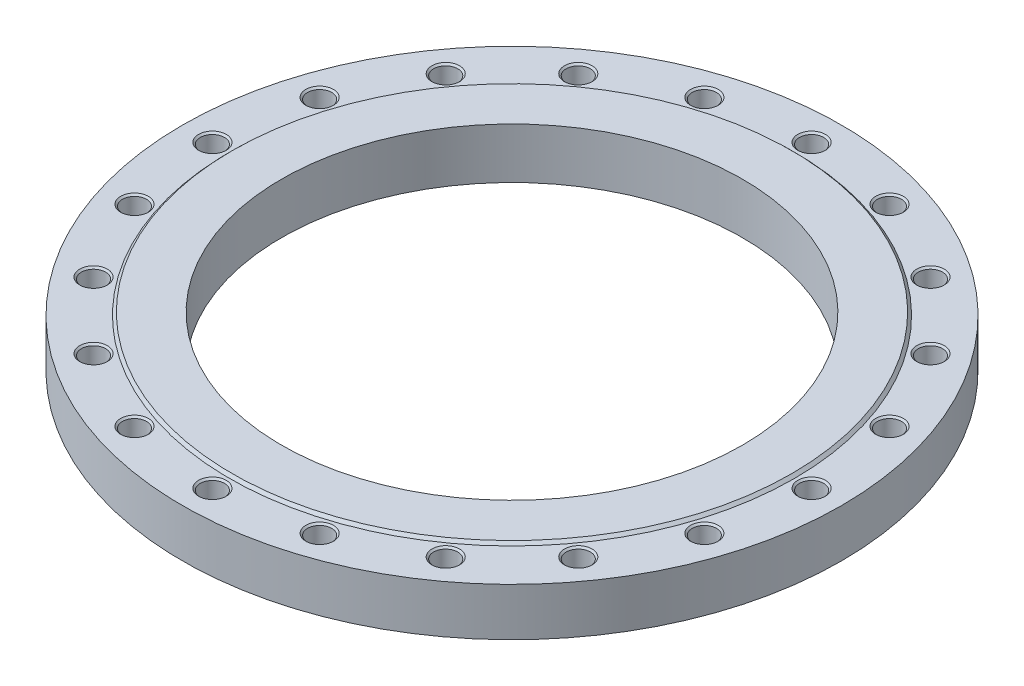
ISO-10303-21;
HEADER;
FILE_DESCRIPTION(('STEP AP214'),'2;1');
FILE_NAME('part.step','',(''),(''),'','','');
FILE_SCHEMA(('AUTOMOTIVE_DESIGN { 1 0 10303 214 1 1 1 1 }'));
ENDSEC;
DATA;
#1=APPLICATION_CONTEXT('core data for automotive mechanical design processes');
#2=APPLICATION_PROTOCOL_DEFINITION('international standard','automotive_design',2000,#1);
#3=PRODUCT_CONTEXT('',#1,'mechanical');
#4=PRODUCT('Part','Part','',(#3));
#5=PRODUCT_RELATED_PRODUCT_CATEGORY('part','',(#4));
#6=PRODUCT_DEFINITION_FORMATION('','',#4);
#7=PRODUCT_DEFINITION_CONTEXT('part definition',#1,'design');
#8=PRODUCT_DEFINITION('design','',#6,#7);
#9=PRODUCT_DEFINITION_SHAPE('','',#8);
#10=(LENGTH_UNIT() NAMED_UNIT(*) SI_UNIT(.MILLI.,.METRE.));
#11=(NAMED_UNIT(*) PLANE_ANGLE_UNIT() SI_UNIT($,.RADIAN.));
#12=(NAMED_UNIT(*) SI_UNIT($,.STERADIAN.) SOLID_ANGLE_UNIT());
#13=UNCERTAINTY_MEASURE_WITH_UNIT(LENGTH_MEASURE(1.E-05),#10,'distance_accuracy_value','');
#14=(GEOMETRIC_REPRESENTATION_CONTEXT(3) GLOBAL_UNCERTAINTY_ASSIGNED_CONTEXT((#13)) GLOBAL_UNIT_ASSIGNED_CONTEXT((#10,
#11,#12)) REPRESENTATION_CONTEXT('',''));
#15=CARTESIAN_POINT('',(0.,0.,0.));
#16=DIRECTION('',(0.,0.,1.));
#17=DIRECTION('',(1.,0.,0.));
#18=AXIS2_PLACEMENT_3D('',#15,#16,#17);
#19=CARTESIAN_POINT('',(0.,26.,0.));
#20=DIRECTION('',(0.,-1.,0.));
#21=DIRECTION('',(1.,0.,0.));
#22=AXIS2_PLACEMENT_3D('',#19,#20,#21);
#23=CYLINDRICAL_SURFACE('',#22,357.5);
#24=CARTESIAN_POINT('',(0.,0.,0.));
#25=DIRECTION('',(0.,1.,0.));
#26=DIRECTION('',(1.,0.,0.));
#27=AXIS2_PLACEMENT_3D('',#24,#25,#26);
#28=CIRCLE('',#27,357.5);
#29=CARTESIAN_POINT('',(357.5,0.,0.));
#30=VERTEX_POINT('',#29);
#31=EDGE_CURVE('E9',#30,#30,#28,.T.);
#32=ORIENTED_EDGE('',*,*,#31,.T.);
#33=EDGE_LOOP('',(#32));
#34=FACE_BOUND('',#33,.T.);
#35=CARTESIAN_POINT('',(0.,52.,0.));
#36=DIRECTION('',(0.,1.,0.));
#37=DIRECTION('',(1.,0.,0.));
#38=AXIS2_PLACEMENT_3D('',#35,#36,#37);
#39=CIRCLE('',#38,357.5);
#40=CARTESIAN_POINT('',(357.5,52.,0.));
#41=VERTEX_POINT('',#40);
#42=EDGE_CURVE('E559',#41,#41,#39,.T.);
#43=ORIENTED_EDGE('',*,*,#42,.F.);
#44=EDGE_LOOP('',(#43));
#45=FACE_BOUND('',#44,.T.);
#46=ADVANCED_FACE('F15',(#34,#45),#23,.T.);
#47=CARTESIAN_POINT('',(303.75,0.,0.));
#48=DIRECTION('',(0.,-1.,0.));
#49=DIRECTION('',(-1.,0.,0.));
#50=AXIS2_PLACEMENT_3D('',#47,#48,#49);
#51=PLANE('',#50);
#52=CARTESIAN_POINT('',(0.,0.,0.));
#53=DIRECTION('',(0.,1.,0.));
#54=DIRECTION('',(1.,0.,0.));
#55=AXIS2_PLACEMENT_3D('',#52,#53,#54);
#56=CIRCLE('',#55,250.);
#57=CARTESIAN_POINT('',(250.,0.,0.));
#58=VERTEX_POINT('',#57);
#59=EDGE_CURVE('E24',#58,#58,#56,.T.);
#60=ORIENTED_EDGE('',*,*,#59,.T.);
#61=EDGE_LOOP('',(#60));
#62=FACE_BOUND('',#61,.T.);
#63=ORIENTED_EDGE('',*,*,#31,.F.);
#64=EDGE_LOOP('',(#63));
#65=FACE_BOUND('',#64,.T.);
#66=ADVANCED_FACE('F737',(#62,#65),#51,.T.);
#67=CARTESIAN_POINT('',(0.,27.5,0.));
#68=DIRECTION('',(0.,-1.,0.));
#69=DIRECTION('',(1.,0.,0.));
#70=AXIS2_PLACEMENT_3D('',#67,#68,#69);
#71=CYLINDRICAL_SURFACE('',#70,250.);
#72=CARTESIAN_POINT('',(0.,55.,0.));
#73=DIRECTION('',(0.,1.,0.));
#74=DIRECTION('',(1.,0.,0.));
#75=AXIS2_PLACEMENT_3D('',#72,#73,#74);
#76=CIRCLE('',#75,250.);
#77=CARTESIAN_POINT('',(250.,55.,0.));
#78=VERTEX_POINT('',#77);
#79=EDGE_CURVE('E578',#78,#78,#76,.T.);
#80=ORIENTED_EDGE('',*,*,#79,.T.);
#81=EDGE_LOOP('',(#80));
#82=FACE_BOUND('',#81,.T.);
#83=ORIENTED_EDGE('',*,*,#59,.F.);
#84=EDGE_LOOP('',(#83));
#85=FACE_BOUND('',#84,.T.);
#86=ADVANCED_FACE('F742',(#82,#85),#71,.F.);
#87=CARTESIAN_POINT('',(276.75,55.,0.));
#88=DIRECTION('',(0.,1.,0.));
#89=DIRECTION('',(1.,0.,0.));
#90=AXIS2_PLACEMENT_3D('',#87,#88,#89);
#91=PLANE('',#90);
#92=CARTESIAN_POINT('',(0.,55.,0.));
#93=DIRECTION('',(0.,1.,0.));
#94=DIRECTION('',(1.,0.,0.));
#95=AXIS2_PLACEMENT_3D('',#92,#93,#94);
#96=CIRCLE('',#95,303.5);
#97=CARTESIAN_POINT('',(303.5,55.,0.));
#98=VERTEX_POINT('',#97);
#99=EDGE_CURVE('E580',#98,#98,#96,.T.);
#100=ORIENTED_EDGE('',*,*,#99,.T.);
#101=EDGE_LOOP('',(#100));
#102=FACE_BOUND('',#101,.T.);
#103=ORIENTED_EDGE('',*,*,#79,.F.);
#104=EDGE_LOOP('',(#103));
#105=FACE_BOUND('',#104,.T.);
#106=ADVANCED_FACE('F846',(#102,#105),#91,.T.);
#107=CARTESIAN_POINT('',(0.,53.5,0.));
#108=DIRECTION('',(0.,-1.,0.));
#109=DIRECTION('',(1.,0.,0.));
#110=AXIS2_PLACEMENT_3D('',#107,#108,#109);
#111=CONICAL_SURFACE('',#110,305.,0.785398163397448);
#112=CARTESIAN_POINT('',(0.,52.,0.));
#113=DIRECTION('',(0.,1.,0.));
#114=DIRECTION('',(1.,0.,0.));
#115=AXIS2_PLACEMENT_3D('',#112,#113,#114);
#116=CIRCLE('',#115,306.5);
#117=CARTESIAN_POINT('',(306.5,52.,0.));
#118=VERTEX_POINT('',#117);
#119=EDGE_CURVE('E491',#118,#118,#116,.T.);
#120=ORIENTED_EDGE('',*,*,#119,.T.);
#121=EDGE_LOOP('',(#120));
#122=FACE_BOUND('',#121,.T.);
#123=ORIENTED_EDGE('',*,*,#99,.F.);
#124=EDGE_LOOP('',(#123));
#125=FACE_BOUND('',#124,.T.);
#126=ADVANCED_FACE('F1190',(#122,#125),#111,.T.);
#127=CARTESIAN_POINT('',(332.,52.,0.));
#128=DIRECTION('',(0.,1.,0.));
#129=DIRECTION('',(1.,0.,0.));
#130=AXIS2_PLACEMENT_3D('',#127,#128,#129);
#131=PLANE('',#130);
#132=ORIENTED_EDGE('',*,*,#42,.T.);
#133=EDGE_LOOP('',(#132));
#134=FACE_BOUND('',#133,.T.);
#135=ORIENTED_EDGE('',*,*,#119,.F.);
#136=EDGE_LOOP('',(#135));
#137=FACE_BOUND('',#136,.T.);
#138=CARTESIAN_POINT('',(325.,52.,0.));
#139=DIRECTION('',(0.,-1.,0.));
#140=DIRECTION('',(1.,0.,0.));
#141=AXIS2_PLACEMENT_3D('',#138,#139,#140);
#142=CIRCLE('',#141,15.);
#143=CARTESIAN_POINT('',(340.,52.,0.));
#144=VERTEX_POINT('',#143);
#145=EDGE_CURVE('E483',#144,#144,#142,.T.);
#146=ORIENTED_EDGE('',*,*,#145,.T.);
#147=EDGE_LOOP('',(#146));
#148=FACE_BOUND('',#147,.T.);
#149=CARTESIAN_POINT('',(309.093367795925,52.,-100.430523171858));
#150=DIRECTION('',(0.,-1.,0.));
#151=DIRECTION('',(0.951056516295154,0.,-0.309016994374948));
#152=AXIS2_PLACEMENT_3D('',#149,#150,#151);
#153=CIRCLE('',#152,15.);
#154=CARTESIAN_POINT('',(323.359215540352,52.,-105.065778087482));
#155=VERTEX_POINT('',#154);
#156=EDGE_CURVE('E574',#155,#155,#153,.T.);
#157=ORIENTED_EDGE('',*,*,#156,.T.);
#158=EDGE_LOOP('',(#157));
#159=FACE_BOUND('',#158,.T.);
#160=CARTESIAN_POINT('',(262.930523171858,52.,-191.030206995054));
#161=DIRECTION('',(0.,-1.,0.));
#162=DIRECTION('',(0.809016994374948,0.,-0.587785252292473));
#163=AXIS2_PLACEMENT_3D('',#160,#161,#162);
#164=CIRCLE('',#163,15.);
#165=CARTESIAN_POINT('',(275.065778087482,52.,-199.846985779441));
#166=VERTEX_POINT('',#165);
#167=EDGE_CURVE('E551',#166,#166,#164,.T.);
#168=ORIENTED_EDGE('',*,*,#167,.T.);
#169=EDGE_LOOP('',(#168));
#170=FACE_BOUND('',#169,.T.);
#171=CARTESIAN_POINT('',(191.030206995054,52.,-262.930523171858));
#172=DIRECTION('',(0.,-1.,0.));
#173=DIRECTION('',(0.587785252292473,0.,-0.809016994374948));
#174=AXIS2_PLACEMENT_3D('',#171,#172,#173);
#175=CIRCLE('',#174,15.);
#176=CARTESIAN_POINT('',(199.846985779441,52.,-275.065778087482));
#177=VERTEX_POINT('',#176);
#178=EDGE_CURVE('E593',#177,#177,#175,.T.);
#179=ORIENTED_EDGE('',*,*,#178,.T.);
#180=EDGE_LOOP('',(#179));
#181=FACE_BOUND('',#180,.T.);
#182=CARTESIAN_POINT('',(100.430523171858,52.,-309.093367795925));
#183=DIRECTION('',(0.,-1.,0.));
#184=DIRECTION('',(0.309016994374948,0.,-0.951056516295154));
#185=AXIS2_PLACEMENT_3D('',#182,#183,#184);
#186=CIRCLE('',#185,15.);
#187=CARTESIAN_POINT('',(105.065778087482,52.,-323.359215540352));
#188=VERTEX_POINT('',#187);
#189=EDGE_CURVE('E678',#188,#188,#186,.T.);
#190=ORIENTED_EDGE('',*,*,#189,.T.);
#191=EDGE_LOOP('',(#190));
#192=FACE_BOUND('',#191,.T.);
#193=CARTESIAN_POINT('',(0.,52.,-325.));
#194=DIRECTION('',(0.,-1.,0.));
#195=DIRECTION('',(0.,0.,-1.));
#196=AXIS2_PLACEMENT_3D('',#193,#194,#195);
#197=CIRCLE('',#196,15.);
#198=CARTESIAN_POINT('',(0.,52.,-340.));
#199=VERTEX_POINT('',#198);
#200=EDGE_CURVE('E632',#199,#199,#197,.T.);
#201=ORIENTED_EDGE('',*,*,#200,.T.);
#202=EDGE_LOOP('',(#201));
#203=FACE_BOUND('',#202,.T.);
#204=CARTESIAN_POINT('',(-100.430523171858,52.,-309.093367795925));
#205=DIRECTION('',(0.,-1.,0.));
#206=DIRECTION('',(-0.309016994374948,0.,-0.951056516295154));
#207=AXIS2_PLACEMENT_3D('',#204,#205,#206);
#208=CIRCLE('',#207,15.);
#209=CARTESIAN_POINT('',(-105.065778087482,52.,-323.359215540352));
#210=VERTEX_POINT('',#209);
#211=EDGE_CURVE('E692',#210,#210,#208,.T.);
#212=ORIENTED_EDGE('',*,*,#211,.T.);
#213=EDGE_LOOP('',(#212));
#214=FACE_BOUND('',#213,.T.);
#215=CARTESIAN_POINT('',(-191.030206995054,52.,-262.930523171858));
#216=DIRECTION('',(0.,-1.,0.));
#217=DIRECTION('',(-0.587785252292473,0.,-0.809016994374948));
#218=AXIS2_PLACEMENT_3D('',#215,#216,#217);
#219=CIRCLE('',#218,15.);
#220=CARTESIAN_POINT('',(-199.846985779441,52.,-275.065778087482));
#221=VERTEX_POINT('',#220);
#222=EDGE_CURVE('E506',#221,#221,#219,.T.);
#223=ORIENTED_EDGE('',*,*,#222,.T.);
#224=EDGE_LOOP('',(#223));
#225=FACE_BOUND('',#224,.T.);
#226=CARTESIAN_POINT('',(-262.930523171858,52.,-191.030206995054));
#227=DIRECTION('',(0.,-1.,0.));
#228=DIRECTION('',(-0.809016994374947,0.,-0.587785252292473));
#229=AXIS2_PLACEMENT_3D('',#226,#227,#228);
#230=CIRCLE('',#229,15.);
#231=CARTESIAN_POINT('',(-275.065778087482,52.,-199.846985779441));
#232=VERTEX_POINT('',#231);
#233=EDGE_CURVE('E665',#232,#232,#230,.T.);
#234=ORIENTED_EDGE('',*,*,#233,.T.);
#235=EDGE_LOOP('',(#234));
#236=FACE_BOUND('',#235,.T.);
#237=CARTESIAN_POINT('',(-309.093367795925,52.,-100.430523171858));
#238=DIRECTION('',(0.,-1.,0.));
#239=DIRECTION('',(-0.951056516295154,0.,-0.309016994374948));
#240=AXIS2_PLACEMENT_3D('',#237,#238,#239);
#241=CIRCLE('',#240,15.);
#242=CARTESIAN_POINT('',(-323.359215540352,52.,-105.065778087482));
#243=VERTEX_POINT('',#242);
#244=EDGE_CURVE('E552',#243,#243,#241,.T.);
#245=ORIENTED_EDGE('',*,*,#244,.T.);
#246=EDGE_LOOP('',(#245));
#247=FACE_BOUND('',#246,.T.);
#248=CARTESIAN_POINT('',(-325.,52.,0.));
#249=DIRECTION('',(0.,-1.,0.));
#250=DIRECTION('',(-1.,0.,0.));
#251=AXIS2_PLACEMENT_3D('',#248,#249,#250);
#252=CIRCLE('',#251,15.);
#253=CARTESIAN_POINT('',(-340.,52.,0.));
#254=VERTEX_POINT('',#253);
#255=EDGE_CURVE('E616',#254,#254,#252,.T.);
#256=ORIENTED_EDGE('',*,*,#255,.T.);
#257=EDGE_LOOP('',(#256));
#258=FACE_BOUND('',#257,.T.);
#259=CARTESIAN_POINT('',(-309.093367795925,52.,100.430523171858));
#260=DIRECTION('',(0.,-1.,0.));
#261=DIRECTION('',(-0.951056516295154,0.,0.309016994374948));
#262=AXIS2_PLACEMENT_3D('',#259,#260,#261);
#263=CIRCLE('',#262,15.);
#264=CARTESIAN_POINT('',(-323.359215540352,52.,105.065778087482));
#265=VERTEX_POINT('',#264);
#266=EDGE_CURVE('E588',#265,#265,#263,.T.);
#267=ORIENTED_EDGE('',*,*,#266,.T.);
#268=EDGE_LOOP('',(#267));
#269=FACE_BOUND('',#268,.T.);
#270=CARTESIAN_POINT('',(-262.930523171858,52.,191.030206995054));
#271=DIRECTION('',(0.,-1.,0.));
#272=DIRECTION('',(-0.809016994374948,0.,0.587785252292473));
#273=AXIS2_PLACEMENT_3D('',#270,#271,#272);
#274=CIRCLE('',#273,15.);
#275=CARTESIAN_POINT('',(-275.065778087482,52.,199.846985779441));
#276=VERTEX_POINT('',#275);
#277=EDGE_CURVE('E625',#276,#276,#274,.T.);
#278=ORIENTED_EDGE('',*,*,#277,.T.);
#279=EDGE_LOOP('',(#278));
#280=FACE_BOUND('',#279,.T.);
#281=CARTESIAN_POINT('',(-191.030206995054,52.,262.930523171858));
#282=DIRECTION('',(0.,-1.,0.));
#283=DIRECTION('',(-0.587785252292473,0.,0.809016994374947));
#284=AXIS2_PLACEMENT_3D('',#281,#282,#283);
#285=CIRCLE('',#284,15.);
#286=CARTESIAN_POINT('',(-199.846985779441,52.,275.065778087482));
#287=VERTEX_POINT('',#286);
#288=EDGE_CURVE('E521',#287,#287,#285,.T.);
#289=ORIENTED_EDGE('',*,*,#288,.T.);
#290=EDGE_LOOP('',(#289));
#291=FACE_BOUND('',#290,.T.);
#292=CARTESIAN_POINT('',(-100.430523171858,52.,309.093367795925));
#293=DIRECTION('',(0.,-1.,0.));
#294=DIRECTION('',(-0.309016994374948,0.,0.951056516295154));
#295=AXIS2_PLACEMENT_3D('',#292,#293,#294);
#296=CIRCLE('',#295,15.);
#297=CARTESIAN_POINT('',(-105.065778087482,52.,323.359215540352));
#298=VERTEX_POINT('',#297);
#299=EDGE_CURVE('E583',#298,#298,#296,.T.);
#300=ORIENTED_EDGE('',*,*,#299,.T.);
#301=EDGE_LOOP('',(#300));
#302=FACE_BOUND('',#301,.T.);
#303=CARTESIAN_POINT('',(0.,52.,325.));
#304=DIRECTION('',(0.,-1.,0.));
#305=DIRECTION('',(0.,0.,1.));
#306=AXIS2_PLACEMENT_3D('',#303,#304,#305);
#307=CIRCLE('',#306,15.);
#308=CARTESIAN_POINT('',(0.,52.,340.));
#309=VERTEX_POINT('',#308);
#310=EDGE_CURVE('E557',#309,#309,#307,.T.);
#311=ORIENTED_EDGE('',*,*,#310,.T.);
#312=EDGE_LOOP('',(#311));
#313=FACE_BOUND('',#312,.T.);
#314=CARTESIAN_POINT('',(100.430523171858,52.,309.093367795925));
#315=DIRECTION('',(0.,-1.,0.));
#316=DIRECTION('',(0.309016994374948,0.,0.951056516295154));
#317=AXIS2_PLACEMENT_3D('',#314,#315,#316);
#318=CIRCLE('',#317,15.);
#319=CARTESIAN_POINT('',(105.065778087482,52.,323.359215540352));
#320=VERTEX_POINT('',#319);
#321=EDGE_CURVE('E541',#320,#320,#318,.T.);
#322=ORIENTED_EDGE('',*,*,#321,.T.);
#323=EDGE_LOOP('',(#322));
#324=FACE_BOUND('',#323,.T.);
#325=CARTESIAN_POINT('',(191.030206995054,52.,262.930523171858));
#326=DIRECTION('',(0.,-1.,0.));
#327=DIRECTION('',(0.587785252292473,0.,0.809016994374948));
#328=AXIS2_PLACEMENT_3D('',#325,#326,#327);
#329=CIRCLE('',#328,15.);
#330=CARTESIAN_POINT('',(199.846985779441,52.,275.065778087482));
#331=VERTEX_POINT('',#330);
#332=EDGE_CURVE('E525',#331,#331,#329,.T.);
#333=ORIENTED_EDGE('',*,*,#332,.T.);
#334=EDGE_LOOP('',(#333));
#335=FACE_BOUND('',#334,.T.);
#336=CARTESIAN_POINT('',(262.930523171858,52.,191.030206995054));
#337=DIRECTION('',(0.,-1.,0.));
#338=DIRECTION('',(0.809016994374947,0.,0.587785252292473));
#339=AXIS2_PLACEMENT_3D('',#336,#337,#338);
#340=CIRCLE('',#339,15.);
#341=CARTESIAN_POINT('',(275.065778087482,52.,199.846985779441));
#342=VERTEX_POINT('',#341);
#343=EDGE_CURVE('E466',#342,#342,#340,.T.);
#344=ORIENTED_EDGE('',*,*,#343,.T.);
#345=EDGE_LOOP('',(#344));
#346=FACE_BOUND('',#345,.T.);
#347=CARTESIAN_POINT('',(309.093367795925,52.,100.430523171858));
#348=DIRECTION('',(0.,-1.,0.));
#349=DIRECTION('',(0.951056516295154,0.,0.309016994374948));
#350=AXIS2_PLACEMENT_3D('',#347,#348,#349);
#351=CIRCLE('',#350,15.);
#352=CARTESIAN_POINT('',(323.359215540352,52.,105.065778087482));
#353=VERTEX_POINT('',#352);
#354=EDGE_CURVE('E488',#353,#353,#351,.T.);
#355=ORIENTED_EDGE('',*,*,#354,.T.);
#356=EDGE_LOOP('',(#355));
#357=FACE_BOUND('',#356,.T.);
#358=ADVANCED_FACE('F467',(#134,#137,#148,#159,#170,#181,#192,#203,#214,#225,#236,#247,#258,
#269,#280,#291,#302,#313,#324,#335,#346,#357),#131,.T.);
#359=CARTESIAN_POINT('',(325.,8.21673193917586,0.));
#360=DIRECTION('',(0.,1.,0.));
#361=DIRECTION('',(1.,0.,0.));
#362=AXIS2_PLACEMENT_3D('',#359,#360,#361);
#363=CONICAL_SURFACE('',#362,6.5528125,1.0471975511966);
#364=CARTESIAN_POINT('',(325.,12.,0.));
#365=DIRECTION('',(0.,-1.,0.));
#366=DIRECTION('',(1.,0.,0.));
#367=AXIS2_PLACEMENT_3D('',#364,#365,#366);
#368=CIRCLE('',#367,13.105625);
#369=CARTESIAN_POINT('',(338.105625,12.,0.));
#370=VERTEX_POINT('',#369);
#371=EDGE_CURVE('E489',#370,#370,#368,.T.);
#372=ORIENTED_EDGE('',*,*,#371,.F.);
#373=EDGE_LOOP('',(#372));
#374=FACE_BOUND('',#373,.T.);
#375=CARTESIAN_POINT('',(325.,4.43346387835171,0.));
#376=VERTEX_POINT('',#375);
#377=VERTEX_LOOP('',#376);
#378=FACE_BOUND('',#377,.T.);
#379=ADVANCED_FACE('F1008',(#374,#378),#363,.F.);
#380=CARTESIAN_POINT('',(325.,16.0528125,0.));
#381=DIRECTION('',(0.,1.,0.));
#382=DIRECTION('',(1.,0.,0.));
#383=AXIS2_PLACEMENT_3D('',#380,#381,#382);
#384=CYLINDRICAL_SURFACE('',#383,13.105625);
#385=CARTESIAN_POINT('',(325.,20.105625,0.));
#386=DIRECTION('',(0.,-1.,0.));
#387=DIRECTION('',(1.,0.,0.));
#388=AXIS2_PLACEMENT_3D('',#385,#386,#387);
#389=CIRCLE('',#388,13.105625);
#390=CARTESIAN_POINT('',(338.105625,20.105625,0.));
#391=VERTEX_POINT('',#390);
#392=EDGE_CURVE('E19',#391,#391,#389,.T.);
#393=ORIENTED_EDGE('',*,*,#392,.F.);
#394=EDGE_LOOP('',(#393));
#395=FACE_BOUND('',#394,.T.);
#396=ORIENTED_EDGE('',*,*,#371,.T.);
#397=EDGE_LOOP('',(#396));
#398=FACE_BOUND('',#397,.T.);
#399=ADVANCED_FACE('F1011',(#395,#398),#384,.F.);
#400=CARTESIAN_POINT('',(325.,21.0528125,0.));
#401=DIRECTION('',(0.,1.,0.));
#402=DIRECTION('',(1.,0.,0.));
#403=AXIS2_PLACEMENT_3D('',#400,#401,#402);
#404=CONICAL_SURFACE('',#403,14.0528125,0.785398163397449);
#405=CARTESIAN_POINT('',(325.,22.,0.));
#406=DIRECTION('',(0.,-1.,0.));
#407=DIRECTION('',(1.,0.,0.));
#408=AXIS2_PLACEMENT_3D('',#405,#406,#407);
#409=CIRCLE('',#408,15.);
#410=CARTESIAN_POINT('',(340.,22.,0.));
#411=VERTEX_POINT('',#410);
#412=EDGE_CURVE('E482',#411,#411,#409,.T.);
#413=ORIENTED_EDGE('',*,*,#412,.F.);
#414=EDGE_LOOP('',(#413));
#415=FACE_BOUND('',#414,.T.);
#416=ORIENTED_EDGE('',*,*,#392,.T.);
#417=EDGE_LOOP('',(#416));
#418=FACE_BOUND('',#417,.T.);
#419=ADVANCED_FACE('F1051',(#415,#418),#404,.F.);
#420=CARTESIAN_POINT('',(339.0528125,22.,0.));
#421=DIRECTION('',(0.,1.,0.));
#422=DIRECTION('',(-1.,0.,0.));
#423=AXIS2_PLACEMENT_3D('',#420,#421,#422);
#424=PLANE('',#423);
#425=CARTESIAN_POINT('',(325.,22.,0.));
#426=DIRECTION('',(0.,-1.,0.));
#427=DIRECTION('',(1.,0.,0.));
#428=AXIS2_PLACEMENT_3D('',#425,#426,#427);
#429=CIRCLE('',#428,13.105625);
#430=CARTESIAN_POINT('',(338.105625,22.,0.));
#431=VERTEX_POINT('',#430);
#432=EDGE_CURVE('E480',#431,#431,#429,.T.);
#433=ORIENTED_EDGE('',*,*,#432,.F.);
#434=EDGE_LOOP('',(#433));
#435=FACE_BOUND('',#434,.T.);
#436=ORIENTED_EDGE('',*,*,#412,.T.);
#437=EDGE_LOOP('',(#436));
#438=FACE_BOUND('',#437,.T.);
#439=ADVANCED_FACE('F1048',(#435,#438),#424,.F.);
#440=CARTESIAN_POINT('',(325.,36.0528125,0.));
#441=DIRECTION('',(0.,1.,0.));
#442=DIRECTION('',(1.,0.,0.));
#443=AXIS2_PLACEMENT_3D('',#440,#441,#442);
#444=CYLINDRICAL_SURFACE('',#443,13.105625);
#445=CARTESIAN_POINT('',(325.,50.105625,0.));
#446=DIRECTION('',(0.,-1.,0.));
#447=DIRECTION('',(1.,0.,0.));
#448=AXIS2_PLACEMENT_3D('',#445,#446,#447);
#449=CIRCLE('',#448,13.105625);
#450=CARTESIAN_POINT('',(338.105625,50.105625,0.));
#451=VERTEX_POINT('',#450);
#452=EDGE_CURVE('E604',#451,#451,#449,.T.);
#453=ORIENTED_EDGE('',*,*,#452,.F.);
#454=EDGE_LOOP('',(#453));
#455=FACE_BOUND('',#454,.T.);
#456=ORIENTED_EDGE('',*,*,#432,.T.);
#457=EDGE_LOOP('',(#456));
#458=FACE_BOUND('',#457,.T.);
#459=ADVANCED_FACE('F731',(#455,#458),#444,.F.);
#460=CARTESIAN_POINT('',(325.,51.0528125,0.));
#461=DIRECTION('',(0.,1.,0.));
#462=DIRECTION('',(1.,0.,0.));
#463=AXIS2_PLACEMENT_3D('',#460,#461,#462);
#464=CONICAL_SURFACE('',#463,14.0528125,0.785398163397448);
#465=ORIENTED_EDGE('',*,*,#145,.F.);
#466=EDGE_LOOP('',(#465));
#467=FACE_BOUND('',#466,.T.);
#468=ORIENTED_EDGE('',*,*,#452,.T.);
#469=EDGE_LOOP('',(#468));
#470=FACE_BOUND('',#469,.T.);
#471=ADVANCED_FACE('F722',(#467,#470),#464,.F.);
#472=CARTESIAN_POINT('',(309.093367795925,8.21673193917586,-100.430523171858));
#473=DIRECTION('',(0.,1.,0.));
#474=DIRECTION('',(0.951056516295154,0.,-0.309016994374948));
#475=AXIS2_PLACEMENT_3D('',#472,#473,#474);
#476=CONICAL_SURFACE('',#475,6.5528125,1.0471975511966);
#477=CARTESIAN_POINT('',(309.093367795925,12.,-100.430523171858));
#478=DIRECTION('',(0.,-1.,0.));
#479=DIRECTION('',(0.951056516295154,0.,-0.309016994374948));
#480=AXIS2_PLACEMENT_3D('',#477,#478,#479);
#481=CIRCLE('',#480,13.105625);
#482=CARTESIAN_POINT('',(321.557557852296,12.,-104.480384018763));
#483=VERTEX_POINT('',#482);
#484=EDGE_CURVE('E606',#483,#483,#481,.T.);
#485=ORIENTED_EDGE('',*,*,#484,.F.);
#486=EDGE_LOOP('',(#485));
#487=FACE_BOUND('',#486,.T.);
#488=CARTESIAN_POINT('',(309.093367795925,4.43346387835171,-100.430523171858));
#489=VERTEX_POINT('',#488);
#490=VERTEX_LOOP('',#489);
#491=FACE_BOUND('',#490,.T.);
#492=ADVANCED_FACE('F719',(#487,#491),#476,.F.);
#493=CARTESIAN_POINT('',(309.093367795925,16.0528125,-100.430523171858));
#494=DIRECTION('',(0.,1.,0.));
#495=DIRECTION('',(0.951056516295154,0.,-0.309016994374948));
#496=AXIS2_PLACEMENT_3D('',#493,#494,#495);
#497=CYLINDRICAL_SURFACE('',#496,13.105625);
#498=CARTESIAN_POINT('',(309.093367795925,20.105625,-100.430523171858));
#499=DIRECTION('',(0.,-1.,0.));
#500=DIRECTION('',(0.951056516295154,0.,-0.309016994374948));
#501=AXIS2_PLACEMENT_3D('',#498,#499,#500);
#502=CIRCLE('',#501,13.105625);
#503=CARTESIAN_POINT('',(321.557557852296,20.105625,-104.480384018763));
#504=VERTEX_POINT('',#503);
#505=EDGE_CURVE('E504',#504,#504,#502,.T.);
#506=ORIENTED_EDGE('',*,*,#505,.F.);
#507=EDGE_LOOP('',(#506));
#508=FACE_BOUND('',#507,.T.);
#509=ORIENTED_EDGE('',*,*,#484,.T.);
#510=EDGE_LOOP('',(#509));
#511=FACE_BOUND('',#510,.T.);
#512=ADVANCED_FACE('F717',(#508,#511),#497,.F.);
#513=CARTESIAN_POINT('',(309.093367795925,21.0528125,-100.430523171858));
#514=DIRECTION('',(0.,1.,0.));
#515=DIRECTION('',(0.951056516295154,0.,-0.309016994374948));
#516=AXIS2_PLACEMENT_3D('',#513,#514,#515);
#517=CONICAL_SURFACE('',#516,14.0528125,0.785398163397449);
#518=CARTESIAN_POINT('',(309.093367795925,22.,-100.430523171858));
#519=DIRECTION('',(0.,-1.,0.));
#520=DIRECTION('',(0.951056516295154,0.,-0.309016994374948));
#521=AXIS2_PLACEMENT_3D('',#518,#519,#520);
#522=CIRCLE('',#521,15.);
#523=CARTESIAN_POINT('',(323.359215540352,22.,-105.065778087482));
#524=VERTEX_POINT('',#523);
#525=EDGE_CURVE('E502',#524,#524,#522,.T.);
#526=ORIENTED_EDGE('',*,*,#525,.F.);
#527=EDGE_LOOP('',(#526));
#528=FACE_BOUND('',#527,.T.);
#529=ORIENTED_EDGE('',*,*,#505,.T.);
#530=EDGE_LOOP('',(#529));
#531=FACE_BOUND('',#530,.T.);
#532=ADVANCED_FACE('F17',(#528,#531),#517,.F.);
#533=CARTESIAN_POINT('',(322.458386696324,22.,-104.773081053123));
#534=DIRECTION('',(0.,1.,0.));
#535=DIRECTION('',(-0.951056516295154,0.,0.309016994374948));
#536=AXIS2_PLACEMENT_3D('',#533,#534,#535);
#537=PLANE('',#536);
#538=CARTESIAN_POINT('',(309.093367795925,22.,-100.430523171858));
#539=DIRECTION('',(0.,-1.,0.));
#540=DIRECTION('',(0.951056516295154,0.,-0.309016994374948));
#541=AXIS2_PLACEMENT_3D('',#538,#539,#540);
#542=CIRCLE('',#541,13.105625);
#543=CARTESIAN_POINT('',(321.557557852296,22.,-104.480384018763));
#544=VERTEX_POINT('',#543);
#545=EDGE_CURVE('E505',#544,#544,#542,.T.);
#546=ORIENTED_EDGE('',*,*,#545,.F.);
#547=EDGE_LOOP('',(#546));
#548=FACE_BOUND('',#547,.T.);
#549=ORIENTED_EDGE('',*,*,#525,.T.);
#550=EDGE_LOOP('',(#549));
#551=FACE_BOUND('',#550,.T.);
#552=ADVANCED_FACE('F1029',(#548,#551),#537,.F.);
#553=CARTESIAN_POINT('',(309.093367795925,36.0528125,-100.430523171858));
#554=DIRECTION('',(0.,1.,0.));
#555=DIRECTION('',(0.951056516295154,0.,-0.309016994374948));
#556=AXIS2_PLACEMENT_3D('',#553,#554,#555);
#557=CYLINDRICAL_SURFACE('',#556,13.105625);
#558=CARTESIAN_POINT('',(309.093367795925,50.105625,-100.430523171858));
#559=DIRECTION('',(0.,-1.,0.));
#560=DIRECTION('',(0.951056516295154,0.,-0.309016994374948));
#561=AXIS2_PLACEMENT_3D('',#558,#559,#560);
#562=CIRCLE('',#561,13.105625);
#563=CARTESIAN_POINT('',(321.557557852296,50.105625,-104.480384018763));
#564=VERTEX_POINT('',#563);
#565=EDGE_CURVE('E572',#564,#564,#562,.T.);
#566=ORIENTED_EDGE('',*,*,#565,.F.);
#567=EDGE_LOOP('',(#566));
#568=FACE_BOUND('',#567,.T.);
#569=ORIENTED_EDGE('',*,*,#545,.T.);
#570=EDGE_LOOP('',(#569));
#571=FACE_BOUND('',#570,.T.);
#572=ADVANCED_FACE('F1032',(#568,#571),#557,.F.);
#573=CARTESIAN_POINT('',(309.093367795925,51.0528125,-100.430523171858));
#574=DIRECTION('',(0.,1.,0.));
#575=DIRECTION('',(0.951056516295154,0.,-0.309016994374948));
#576=AXIS2_PLACEMENT_3D('',#573,#574,#575);
#577=CONICAL_SURFACE('',#576,14.0528125,0.785398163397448);
#578=ORIENTED_EDGE('',*,*,#156,.F.);
#579=EDGE_LOOP('',(#578));
#580=FACE_BOUND('',#579,.T.);
#581=ORIENTED_EDGE('',*,*,#565,.T.);
#582=EDGE_LOOP('',(#581));
#583=FACE_BOUND('',#582,.T.);
#584=ADVANCED_FACE('F797',(#580,#583),#577,.F.);
#585=CARTESIAN_POINT('',(262.930523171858,8.21673193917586,-191.030206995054));
#586=DIRECTION('',(0.,1.,0.));
#587=DIRECTION('',(0.809016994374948,0.,-0.587785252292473));
#588=AXIS2_PLACEMENT_3D('',#585,#586,#587);
#589=CONICAL_SURFACE('',#588,6.5528125,1.0471975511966);
#590=CARTESIAN_POINT('',(262.930523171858,12.,-191.030206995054));
#591=DIRECTION('',(0.,-1.,0.));
#592=DIRECTION('',(0.809016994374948,0.,-0.587785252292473));
#593=AXIS2_PLACEMENT_3D('',#590,#591,#592);
#594=CIRCLE('',#593,13.105625);
#595=CARTESIAN_POINT('',(273.533196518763,12.,-198.73350009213));
#596=VERTEX_POINT('',#595);
#597=EDGE_CURVE('E575',#596,#596,#594,.T.);
#598=ORIENTED_EDGE('',*,*,#597,.F.);
#599=EDGE_LOOP('',(#598));
#600=FACE_BOUND('',#599,.T.);
#601=CARTESIAN_POINT('',(262.930523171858,4.43346387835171,-191.030206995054));
#602=VERTEX_POINT('',#601);
#603=VERTEX_LOOP('',#602);
#604=FACE_BOUND('',#603,.T.);
#605=ADVANCED_FACE('F793',(#600,#604),#589,.F.);
#606=CARTESIAN_POINT('',(262.930523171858,16.0528125,-191.030206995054));
#607=DIRECTION('',(0.,1.,0.));
#608=DIRECTION('',(0.809016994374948,0.,-0.587785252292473));
#609=AXIS2_PLACEMENT_3D('',#606,#607,#608);
#610=CYLINDRICAL_SURFACE('',#609,13.105625);
#611=CARTESIAN_POINT('',(262.930523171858,20.105625,-191.030206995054));
#612=DIRECTION('',(0.,-1.,0.));
#613=DIRECTION('',(0.809016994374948,0.,-0.587785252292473));
#614=AXIS2_PLACEMENT_3D('',#611,#612,#613);
#615=CIRCLE('',#614,13.105625);
#616=CARTESIAN_POINT('',(273.533196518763,20.105625,-198.73350009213));
#617=VERTEX_POINT('',#616);
#618=EDGE_CURVE('E639',#617,#617,#615,.T.);
#619=ORIENTED_EDGE('',*,*,#618,.F.);
#620=EDGE_LOOP('',(#619));
#621=FACE_BOUND('',#620,.T.);
#622=ORIENTED_EDGE('',*,*,#597,.T.);
#623=EDGE_LOOP('',(#622));
#624=FACE_BOUND('',#623,.T.);
#625=ADVANCED_FACE('F796',(#621,#624),#610,.F.);
#626=CARTESIAN_POINT('',(262.930523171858,21.0528125,-191.030206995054));
#627=DIRECTION('',(0.,1.,0.));
#628=DIRECTION('',(0.809016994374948,0.,-0.587785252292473));
#629=AXIS2_PLACEMENT_3D('',#626,#627,#628);
#630=CONICAL_SURFACE('',#629,14.0528125,0.785398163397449);
#631=CARTESIAN_POINT('',(262.930523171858,22.,-191.030206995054));
#632=DIRECTION('',(0.,-1.,0.));
#633=DIRECTION('',(0.809016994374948,0.,-0.587785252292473));
#634=AXIS2_PLACEMENT_3D('',#631,#632,#633);
#635=CIRCLE('',#634,15.);
#636=CARTESIAN_POINT('',(275.065778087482,22.,-199.846985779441));
#637=VERTEX_POINT('',#636);
#638=EDGE_CURVE('E550',#637,#637,#635,.T.);
#639=ORIENTED_EDGE('',*,*,#638,.F.);
#640=EDGE_LOOP('',(#639));
#641=FACE_BOUND('',#640,.T.);
#642=ORIENTED_EDGE('',*,*,#618,.T.);
#643=EDGE_LOOP('',(#642));
#644=FACE_BOUND('',#643,.T.);
#645=ADVANCED_FACE('F1111',(#641,#644),#630,.F.);
#646=CARTESIAN_POINT('',(274.299487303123,22.,-199.290242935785));
#647=DIRECTION('',(0.,1.,0.));
#648=DIRECTION('',(-0.809016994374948,0.,0.587785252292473));
#649=AXIS2_PLACEMENT_3D('',#646,#647,#648);
#650=PLANE('',#649);
#651=CARTESIAN_POINT('',(262.930523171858,22.,-191.030206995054));
#652=DIRECTION('',(0.,-1.,0.));
#653=DIRECTION('',(0.809016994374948,0.,-0.587785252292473));
#654=AXIS2_PLACEMENT_3D('',#651,#652,#653);
#655=CIRCLE('',#654,13.105625);
#656=CARTESIAN_POINT('',(273.533196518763,22.,-198.73350009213));
#657=VERTEX_POINT('',#656);
#658=EDGE_CURVE('E548',#657,#657,#655,.T.);
#659=ORIENTED_EDGE('',*,*,#658,.F.);
#660=EDGE_LOOP('',(#659));
#661=FACE_BOUND('',#660,.T.);
#662=ORIENTED_EDGE('',*,*,#638,.T.);
#663=EDGE_LOOP('',(#662));
#664=FACE_BOUND('',#663,.T.);
#665=ADVANCED_FACE('F1108',(#661,#664),#650,.F.);
#666=CARTESIAN_POINT('',(262.930523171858,36.0528125,-191.030206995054));
#667=DIRECTION('',(0.,1.,0.));
#668=DIRECTION('',(0.809016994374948,0.,-0.587785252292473));
#669=AXIS2_PLACEMENT_3D('',#666,#667,#668);
#670=CYLINDRICAL_SURFACE('',#669,13.105625);
#671=CARTESIAN_POINT('',(262.930523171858,50.105625,-191.030206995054));
#672=DIRECTION('',(0.,-1.,0.));
#673=DIRECTION('',(0.809016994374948,0.,-0.587785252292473));
#674=AXIS2_PLACEMENT_3D('',#671,#672,#673);
#675=CIRCLE('',#674,13.105625);
#676=CARTESIAN_POINT('',(273.533196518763,50.105625,-198.73350009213));
#677=VERTEX_POINT('',#676);
#678=EDGE_CURVE('E610',#677,#677,#675,.T.);
#679=ORIENTED_EDGE('',*,*,#678,.F.);
#680=EDGE_LOOP('',(#679));
#681=FACE_BOUND('',#680,.T.);
#682=ORIENTED_EDGE('',*,*,#658,.T.);
#683=EDGE_LOOP('',(#682));
#684=FACE_BOUND('',#683,.T.);
#685=ADVANCED_FACE('F830',(#681,#684),#670,.F.);
#686=CARTESIAN_POINT('',(262.930523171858,51.0528125,-191.030206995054));
#687=DIRECTION('',(0.,1.,0.));
#688=DIRECTION('',(0.809016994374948,0.,-0.587785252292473));
#689=AXIS2_PLACEMENT_3D('',#686,#687,#688);
#690=CONICAL_SURFACE('',#689,14.0528125,0.785398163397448);
#691=ORIENTED_EDGE('',*,*,#167,.F.);
#692=EDGE_LOOP('',(#691));
#693=FACE_BOUND('',#692,.T.);
#694=ORIENTED_EDGE('',*,*,#678,.T.);
#695=EDGE_LOOP('',(#694));
#696=FACE_BOUND('',#695,.T.);
#697=ADVANCED_FACE('F826',(#693,#696),#690,.F.);
#698=CARTESIAN_POINT('',(191.030206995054,8.21673193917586,-262.930523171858));
#699=DIRECTION('',(0.,1.,0.));
#700=DIRECTION('',(0.587785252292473,0.,-0.809016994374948));
#701=AXIS2_PLACEMENT_3D('',#698,#699,#700);
#702=CONICAL_SURFACE('',#701,6.5528125,1.0471975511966);
#703=CARTESIAN_POINT('',(191.030206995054,12.,-262.930523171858));
#704=DIRECTION('',(0.,-1.,0.));
#705=DIRECTION('',(0.587785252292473,0.,-0.809016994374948));
#706=AXIS2_PLACEMENT_3D('',#703,#704,#705);
#707=CIRCLE('',#706,13.105625);
#708=CARTESIAN_POINT('',(198.73350009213,12.,-273.533196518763));
#709=VERTEX_POINT('',#708);
#710=EDGE_CURVE('E608',#709,#709,#707,.T.);
#711=ORIENTED_EDGE('',*,*,#710,.F.);
#712=EDGE_LOOP('',(#711));
#713=FACE_BOUND('',#712,.T.);
#714=CARTESIAN_POINT('',(191.030206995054,4.43346387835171,-262.930523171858));
#715=VERTEX_POINT('',#714);
#716=VERTEX_LOOP('',#715);
#717=FACE_BOUND('',#716,.T.);
#718=ADVANCED_FACE('F829',(#713,#717),#702,.F.);
#719=CARTESIAN_POINT('',(191.030206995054,16.0528125,-262.930523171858));
#720=DIRECTION('',(0.,1.,0.));
#721=DIRECTION('',(0.587785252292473,0.,-0.809016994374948));
#722=AXIS2_PLACEMENT_3D('',#719,#720,#721);
#723=CYLINDRICAL_SURFACE('',#722,13.105625);
#724=CARTESIAN_POINT('',(191.030206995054,20.105625,-262.930523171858));
#725=DIRECTION('',(0.,-1.,0.));
#726=DIRECTION('',(0.587785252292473,0.,-0.809016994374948));
#727=AXIS2_PLACEMENT_3D('',#724,#725,#726);
#728=CIRCLE('',#727,13.105625);
#729=CARTESIAN_POINT('',(198.73350009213,20.105625,-273.533196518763));
#730=VERTEX_POINT('',#729);
#731=EDGE_CURVE('E494',#730,#730,#728,.T.);
#732=ORIENTED_EDGE('',*,*,#731,.F.);
#733=EDGE_LOOP('',(#732));
#734=FACE_BOUND('',#733,.T.);
#735=ORIENTED_EDGE('',*,*,#710,.T.);
#736=EDGE_LOOP('',(#735));
#737=FACE_BOUND('',#736,.T.);
#738=ADVANCED_FACE('F1068',(#734,#737),#723,.F.);
#739=CARTESIAN_POINT('',(191.030206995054,21.0528125,-262.930523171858));
#740=DIRECTION('',(0.,1.,0.));
#741=DIRECTION('',(0.587785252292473,0.,-0.809016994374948));
#742=AXIS2_PLACEMENT_3D('',#739,#740,#741);
#743=CONICAL_SURFACE('',#742,14.0528125,0.785398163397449);
#744=CARTESIAN_POINT('',(191.030206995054,22.,-262.930523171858));
#745=DIRECTION('',(0.,-1.,0.));
#746=DIRECTION('',(0.587785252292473,0.,-0.809016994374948));
#747=AXIS2_PLACEMENT_3D('',#744,#745,#746);
#748=CIRCLE('',#747,15.);
#749=CARTESIAN_POINT('',(199.846985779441,22.,-275.065778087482));
#750=VERTEX_POINT('',#749);
#751=EDGE_CURVE('E492',#750,#750,#748,.T.);
#752=ORIENTED_EDGE('',*,*,#751,.F.);
#753=EDGE_LOOP('',(#752));
#754=FACE_BOUND('',#753,.T.);
#755=ORIENTED_EDGE('',*,*,#731,.T.);
#756=EDGE_LOOP('',(#755));
#757=FACE_BOUND('',#756,.T.);
#758=ADVANCED_FACE('F1079',(#754,#757),#743,.F.);
#759=CARTESIAN_POINT('',(199.290242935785,22.,-274.299487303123));
#760=DIRECTION('',(0.,1.,0.));
#761=DIRECTION('',(-0.587785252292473,0.,0.809016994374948));
#762=AXIS2_PLACEMENT_3D('',#759,#760,#761);
#763=PLANE('',#762);
#764=CARTESIAN_POINT('',(191.030206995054,22.,-262.930523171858));
#765=DIRECTION('',(0.,-1.,0.));
#766=DIRECTION('',(0.587785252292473,0.,-0.809016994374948));
#767=AXIS2_PLACEMENT_3D('',#764,#765,#766);
#768=CIRCLE('',#767,13.105625);
#769=CARTESIAN_POINT('',(198.73350009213,22.,-273.533196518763));
#770=VERTEX_POINT('',#769);
#771=EDGE_CURVE('E495',#770,#770,#768,.T.);
#772=ORIENTED_EDGE('',*,*,#771,.F.);
#773=EDGE_LOOP('',(#772));
#774=FACE_BOUND('',#773,.T.);
#775=ORIENTED_EDGE('',*,*,#751,.T.);
#776=EDGE_LOOP('',(#775));
#777=FACE_BOUND('',#776,.T.);
#778=ADVANCED_FACE('F1135',(#774,#777),#763,.F.);
#779=CARTESIAN_POINT('',(191.030206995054,36.0528125,-262.930523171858));
#780=DIRECTION('',(0.,1.,0.));
#781=DIRECTION('',(0.587785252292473,0.,-0.809016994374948));
#782=AXIS2_PLACEMENT_3D('',#779,#780,#781);
#783=CYLINDRICAL_SURFACE('',#782,13.105625);
#784=CARTESIAN_POINT('',(191.030206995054,50.105625,-262.930523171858));
#785=DIRECTION('',(0.,-1.,0.));
#786=DIRECTION('',(0.587785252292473,0.,-0.809016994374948));
#787=AXIS2_PLACEMENT_3D('',#784,#785,#786);
#788=CIRCLE('',#787,13.105625);
#789=CARTESIAN_POINT('',(198.73350009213,50.105625,-273.533196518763));
#790=VERTEX_POINT('',#789);
#791=EDGE_CURVE('E591',#790,#790,#788,.T.);
#792=ORIENTED_EDGE('',*,*,#791,.F.);
#793=EDGE_LOOP('',(#792));
#794=FACE_BOUND('',#793,.T.);
#795=ORIENTED_EDGE('',*,*,#771,.T.);
#796=EDGE_LOOP('',(#795));
#797=FACE_BOUND('',#796,.T.);
#798=ADVANCED_FACE('F1186',(#794,#797),#783,.F.);
#799=CARTESIAN_POINT('',(191.030206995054,51.0528125,-262.930523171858));
#800=DIRECTION('',(0.,1.,0.));
#801=DIRECTION('',(0.587785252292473,0.,-0.809016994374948));
#802=AXIS2_PLACEMENT_3D('',#799,#800,#801);
#803=CONICAL_SURFACE('',#802,14.0528125,0.785398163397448);
#804=ORIENTED_EDGE('',*,*,#178,.F.);
#805=EDGE_LOOP('',(#804));
#806=FACE_BOUND('',#805,.T.);
#807=ORIENTED_EDGE('',*,*,#791,.T.);
#808=EDGE_LOOP('',(#807));
#809=FACE_BOUND('',#808,.T.);
#810=ADVANCED_FACE('F952',(#806,#809),#803,.F.);
#811=CARTESIAN_POINT('',(100.430523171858,8.21673193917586,-309.093367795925));
#812=DIRECTION('',(0.,1.,0.));
#813=DIRECTION('',(0.309016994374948,0.,-0.951056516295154));
#814=AXIS2_PLACEMENT_3D('',#811,#812,#813);
#815=CONICAL_SURFACE('',#814,6.5528125,1.0471975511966);
#816=CARTESIAN_POINT('',(100.430523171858,12.,-309.093367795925));
#817=DIRECTION('',(0.,-1.,0.));
#818=DIRECTION('',(0.309016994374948,0.,-0.951056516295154));
#819=AXIS2_PLACEMENT_3D('',#816,#817,#818);
#820=CIRCLE('',#819,13.105625);
#821=CARTESIAN_POINT('',(104.480384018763,12.,-321.557557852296));
#822=VERTEX_POINT('',#821);
#823=EDGE_CURVE('E594',#822,#822,#820,.T.);
#824=ORIENTED_EDGE('',*,*,#823,.F.);
#825=EDGE_LOOP('',(#824));
#826=FACE_BOUND('',#825,.T.);
#827=CARTESIAN_POINT('',(100.430523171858,4.43346387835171,-309.093367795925));
#828=VERTEX_POINT('',#827);
#829=VERTEX_LOOP('',#828);
#830=FACE_BOUND('',#829,.T.);
#831=ADVANCED_FACE('F948',(#826,#830),#815,.F.);
#832=CARTESIAN_POINT('',(100.430523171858,16.0528125,-309.093367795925));
#833=DIRECTION('',(0.,1.,0.));
#834=DIRECTION('',(0.309016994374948,0.,-0.951056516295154));
#835=AXIS2_PLACEMENT_3D('',#832,#833,#834);
#836=CYLINDRICAL_SURFACE('',#835,13.105625);
#837=CARTESIAN_POINT('',(100.430523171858,20.105625,-309.093367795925));
#838=DIRECTION('',(0.,-1.,0.));
#839=DIRECTION('',(0.309016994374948,0.,-0.951056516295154));
#840=AXIS2_PLACEMENT_3D('',#837,#838,#839);
#841=CIRCLE('',#840,13.105625);
#842=CARTESIAN_POINT('',(104.480384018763,20.105625,-321.557557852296));
#843=VERTEX_POINT('',#842);
#844=EDGE_CURVE('E710',#843,#843,#841,.T.);
#845=ORIENTED_EDGE('',*,*,#844,.F.);
#846=EDGE_LOOP('',(#845));
#847=FACE_BOUND('',#846,.T.);
#848=ORIENTED_EDGE('',*,*,#823,.T.);
#849=EDGE_LOOP('',(#848));
#850=FACE_BOUND('',#849,.T.);
#851=ADVANCED_FACE('F951',(#847,#850),#836,.F.);
#852=CARTESIAN_POINT('',(100.430523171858,21.0528125,-309.093367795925));
#853=DIRECTION('',(0.,1.,0.));
#854=DIRECTION('',(0.309016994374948,0.,-0.951056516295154));
#855=AXIS2_PLACEMENT_3D('',#852,#853,#854);
#856=CONICAL_SURFACE('',#855,14.0528125,0.785398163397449);
#857=CARTESIAN_POINT('',(100.430523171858,22.,-309.093367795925));
#858=DIRECTION('',(0.,-1.,0.));
#859=DIRECTION('',(0.309016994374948,0.,-0.951056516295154));
#860=AXIS2_PLACEMENT_3D('',#857,#858,#859);
#861=CIRCLE('',#860,15.);
#862=CARTESIAN_POINT('',(105.065778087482,22.,-323.359215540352));
#863=VERTEX_POINT('',#862);
#864=EDGE_CURVE('E707',#863,#863,#861,.T.);
#865=ORIENTED_EDGE('',*,*,#864,.F.);
#866=EDGE_LOOP('',(#865));
#867=FACE_BOUND('',#866,.T.);
#868=ORIENTED_EDGE('',*,*,#844,.T.);
#869=EDGE_LOOP('',(#868));
#870=FACE_BOUND('',#869,.T.);
#871=ADVANCED_FACE('F765',(#867,#870),#856,.F.);
#872=CARTESIAN_POINT('',(104.773081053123,22.,-322.458386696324));
#873=DIRECTION('',(0.,1.,0.));
#874=DIRECTION('',(-0.309016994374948,0.,0.951056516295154));
#875=AXIS2_PLACEMENT_3D('',#872,#873,#874);
#876=PLANE('',#875);
#877=CARTESIAN_POINT('',(100.430523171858,22.,-309.093367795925));
#878=DIRECTION('',(0.,-1.,0.));
#879=DIRECTION('',(0.309016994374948,0.,-0.951056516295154));
#880=AXIS2_PLACEMENT_3D('',#877,#878,#879);
#881=CIRCLE('',#880,13.105625);
#882=CARTESIAN_POINT('',(104.480384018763,22.,-321.557557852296));
#883=VERTEX_POINT('',#882);
#884=EDGE_CURVE('E680',#883,#883,#881,.T.);
#885=ORIENTED_EDGE('',*,*,#884,.F.);
#886=EDGE_LOOP('',(#885));
#887=FACE_BOUND('',#886,.T.);
#888=ORIENTED_EDGE('',*,*,#864,.T.);
#889=EDGE_LOOP('',(#888));
#890=FACE_BOUND('',#889,.T.);
#891=ADVANCED_FACE('F761',(#887,#890),#876,.F.);
#892=CARTESIAN_POINT('',(100.430523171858,36.0528125,-309.093367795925));
#893=DIRECTION('',(0.,1.,0.));
#894=DIRECTION('',(0.309016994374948,0.,-0.951056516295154));
#895=AXIS2_PLACEMENT_3D('',#892,#893,#894);
#896=CYLINDRICAL_SURFACE('',#895,13.105625);
#897=CARTESIAN_POINT('',(100.430523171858,50.105625,-309.093367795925));
#898=DIRECTION('',(0.,-1.,0.));
#899=DIRECTION('',(0.309016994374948,0.,-0.951056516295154));
#900=AXIS2_PLACEMENT_3D('',#897,#898,#899);
#901=CIRCLE('',#900,13.105625);
#902=CARTESIAN_POINT('',(104.480384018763,50.105625,-321.557557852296));
#903=VERTEX_POINT('',#902);
#904=EDGE_CURVE('E681',#903,#903,#901,.T.);
#905=ORIENTED_EDGE('',*,*,#904,.F.);
#906=EDGE_LOOP('',(#905));
#907=FACE_BOUND('',#906,.T.);
#908=ORIENTED_EDGE('',*,*,#884,.T.);
#909=EDGE_LOOP('',(#908));
#910=FACE_BOUND('',#909,.T.);
#911=ADVANCED_FACE('F764',(#907,#910),#896,.F.);
#912=CARTESIAN_POINT('',(100.430523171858,51.0528125,-309.093367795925));
#913=DIRECTION('',(0.,1.,0.));
#914=DIRECTION('',(0.309016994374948,0.,-0.951056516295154));
#915=AXIS2_PLACEMENT_3D('',#912,#913,#914);
#916=CONICAL_SURFACE('',#915,14.0528125,0.785398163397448);
#917=ORIENTED_EDGE('',*,*,#189,.F.);
#918=EDGE_LOOP('',(#917));
#919=FACE_BOUND('',#918,.T.);
#920=ORIENTED_EDGE('',*,*,#904,.T.);
#921=EDGE_LOOP('',(#920));
#922=FACE_BOUND('',#921,.T.);
#923=ADVANCED_FACE('F904',(#919,#922),#916,.F.);
#924=CARTESIAN_POINT('',(0.,8.21673193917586,-325.));
#925=DIRECTION('',(0.,1.,0.));
#926=DIRECTION('',(0.,0.,-1.));
#927=AXIS2_PLACEMENT_3D('',#924,#925,#926);
#928=CONICAL_SURFACE('',#927,6.5528125,1.0471975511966);
#929=CARTESIAN_POINT('',(0.,12.,-325.));
#930=DIRECTION('',(0.,-1.,0.));
#931=DIRECTION('',(0.,0.,-1.));
#932=AXIS2_PLACEMENT_3D('',#929,#930,#931);
#933=CIRCLE('',#932,13.105625);
#934=CARTESIAN_POINT('',(0.,12.,-338.105625));
#935=VERTEX_POINT('',#934);
#936=EDGE_CURVE('E704',#935,#935,#933,.T.);
#937=ORIENTED_EDGE('',*,*,#936,.F.);
#938=EDGE_LOOP('',(#937));
#939=FACE_BOUND('',#938,.T.);
#940=CARTESIAN_POINT('',(0.,4.43346387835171,-325.));
#941=VERTEX_POINT('',#940);
#942=VERTEX_LOOP('',#941);
#943=FACE_BOUND('',#942,.T.);
#944=ADVANCED_FACE('F907',(#939,#943),#928,.F.);
#945=CARTESIAN_POINT('',(0.,16.0528125,-325.));
#946=DIRECTION('',(0.,1.,0.));
#947=DIRECTION('',(0.,0.,-1.));
#948=AXIS2_PLACEMENT_3D('',#945,#946,#947);
#949=CYLINDRICAL_SURFACE('',#948,13.105625);
#950=CARTESIAN_POINT('',(0.,20.105625,-325.));
#951=DIRECTION('',(0.,-1.,0.));
#952=DIRECTION('',(0.,0.,-1.));
#953=AXIS2_PLACEMENT_3D('',#950,#951,#952);
#954=CIRCLE('',#953,13.105625);
#955=CARTESIAN_POINT('',(0.,20.105625,-338.105625));
#956=VERTEX_POINT('',#955);
#957=EDGE_CURVE('E479',#956,#956,#954,.T.);
#958=ORIENTED_EDGE('',*,*,#957,.F.);
#959=EDGE_LOOP('',(#958));
#960=FACE_BOUND('',#959,.T.);
#961=ORIENTED_EDGE('',*,*,#936,.T.);
#962=EDGE_LOOP('',(#961));
#963=FACE_BOUND('',#962,.T.);
#964=ADVANCED_FACE('F819',(#960,#963),#949,.F.);
#965=CARTESIAN_POINT('',(0.,21.0528125,-325.));
#966=DIRECTION('',(0.,1.,0.));
#967=DIRECTION('',(0.,0.,-1.));
#968=AXIS2_PLACEMENT_3D('',#965,#966,#967);
#969=CONICAL_SURFACE('',#968,14.0528125,0.785398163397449);
#970=CARTESIAN_POINT('',(0.,22.,-325.));
#971=DIRECTION('',(0.,-1.,0.));
#972=DIRECTION('',(0.,0.,-1.));
#973=AXIS2_PLACEMENT_3D('',#970,#971,#972);
#974=CIRCLE('',#973,15.);
#975=CARTESIAN_POINT('',(0.,22.,-340.));
#976=VERTEX_POINT('',#975);
#977=EDGE_CURVE('E701',#976,#976,#974,.T.);
#978=ORIENTED_EDGE('',*,*,#977,.F.);
#979=EDGE_LOOP('',(#978));
#980=FACE_BOUND('',#979,.T.);
#981=ORIENTED_EDGE('',*,*,#957,.T.);
#982=EDGE_LOOP('',(#981));
#983=FACE_BOUND('',#982,.T.);
#984=ADVANCED_FACE('F815',(#980,#983),#969,.F.);
#985=CARTESIAN_POINT('',(0.,22.,-339.0528125));
#986=DIRECTION('',(0.,1.,0.));
#987=DIRECTION('',(0.,0.,1.));
#988=AXIS2_PLACEMENT_3D('',#985,#986,#987);
#989=PLANE('',#988);
#990=CARTESIAN_POINT('',(0.,22.,-325.));
#991=DIRECTION('',(0.,-1.,0.));
#992=DIRECTION('',(0.,0.,-1.));
#993=AXIS2_PLACEMENT_3D('',#990,#991,#992);
#994=CIRCLE('',#993,13.105625);
#995=CARTESIAN_POINT('',(0.,22.,-338.105625));
#996=VERTEX_POINT('',#995);
#997=EDGE_CURVE('E699',#996,#996,#994,.T.);
#998=ORIENTED_EDGE('',*,*,#997,.F.);
#999=EDGE_LOOP('',(#998));
#1000=FACE_BOUND('',#999,.T.);
#1001=ORIENTED_EDGE('',*,*,#977,.T.);
#1002=EDGE_LOOP('',(#1001));
#1003=FACE_BOUND('',#1002,.T.);
#1004=ADVANCED_FACE('F818',(#1000,#1003),#989,.F.);
#1005=CARTESIAN_POINT('',(0.,36.0528125,-325.));
#1006=DIRECTION('',(0.,1.,0.));
#1007=DIRECTION('',(0.,0.,-1.));
#1008=AXIS2_PLACEMENT_3D('',#1005,#1006,#1007);
#1009=CYLINDRICAL_SURFACE('',#1008,13.105625);
#1010=CARTESIAN_POINT('',(0.,50.105625,-325.));
#1011=DIRECTION('',(0.,-1.,0.));
#1012=DIRECTION('',(0.,0.,-1.));
#1013=AXIS2_PLACEMENT_3D('',#1010,#1011,#1012);
#1014=CIRCLE('',#1013,13.105625);
#1015=CARTESIAN_POINT('',(0.,50.105625,-338.105625));
#1016=VERTEX_POINT('',#1015);
#1017=EDGE_CURVE('E630',#1016,#1016,#1014,.T.);
#1018=ORIENTED_EDGE('',*,*,#1017,.F.);
#1019=EDGE_LOOP('',(#1018));
#1020=FACE_BOUND('',#1019,.T.);
#1021=ORIENTED_EDGE('',*,*,#997,.T.);
#1022=EDGE_LOOP('',(#1021));
#1023=FACE_BOUND('',#1022,.T.);
#1024=ADVANCED_FACE('F972',(#1020,#1023),#1009,.F.);
#1025=CARTESIAN_POINT('',(0.,51.0528125,-325.));
#1026=DIRECTION('',(0.,1.,0.));
#1027=DIRECTION('',(0.,0.,-1.));
#1028=AXIS2_PLACEMENT_3D('',#1025,#1026,#1027);
#1029=CONICAL_SURFACE('',#1028,14.0528125,0.785398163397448);
#1030=ORIENTED_EDGE('',*,*,#200,.F.);
#1031=EDGE_LOOP('',(#1030));
#1032=FACE_BOUND('',#1031,.T.);
#1033=ORIENTED_EDGE('',*,*,#1017,.T.);
#1034=EDGE_LOOP('',(#1033));
#1035=FACE_BOUND('',#1034,.T.);
#1036=ADVANCED_FACE('F968',(#1032,#1035),#1029,.F.);
#1037=CARTESIAN_POINT('',(-100.430523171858,8.21673193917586,-309.093367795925));
#1038=DIRECTION('',(0.,1.,0.));
#1039=DIRECTION('',(-0.309016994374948,0.,-0.951056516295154));
#1040=AXIS2_PLACEMENT_3D('',#1037,#1038,#1039);
#1041=CONICAL_SURFACE('',#1040,6.5528125,1.0471975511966);
#1042=CARTESIAN_POINT('',(-100.430523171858,12.,-309.093367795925));
#1043=DIRECTION('',(0.,-1.,0.));
#1044=DIRECTION('',(-0.309016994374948,0.,-0.951056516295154));
#1045=AXIS2_PLACEMENT_3D('',#1042,#1043,#1044);
#1046=CIRCLE('',#1045,13.105625);
#1047=CARTESIAN_POINT('',(-104.480384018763,12.,-321.557557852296));
#1048=VERTEX_POINT('',#1047);
#1049=EDGE_CURVE('E633',#1048,#1048,#1046,.T.);
#1050=ORIENTED_EDGE('',*,*,#1049,.F.);
#1051=EDGE_LOOP('',(#1050));
#1052=FACE_BOUND('',#1051,.T.);
#1053=CARTESIAN_POINT('',(-100.430523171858,4.43346387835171,-309.093367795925));
#1054=VERTEX_POINT('',#1053);
#1055=VERTEX_LOOP('',#1054);
#1056=FACE_BOUND('',#1055,.T.);
#1057=ADVANCED_FACE('F971',(#1052,#1056),#1041,.F.);
#1058=CARTESIAN_POINT('',(-100.430523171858,16.0528125,-309.093367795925));
#1059=DIRECTION('',(0.,1.,0.));
#1060=DIRECTION('',(-0.309016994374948,0.,-0.951056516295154));
#1061=AXIS2_PLACEMENT_3D('',#1058,#1059,#1060);
#1062=CYLINDRICAL_SURFACE('',#1061,13.105625);
#1063=CARTESIAN_POINT('',(-100.430523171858,20.105625,-309.093367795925));
#1064=DIRECTION('',(0.,-1.,0.));
#1065=DIRECTION('',(-0.309016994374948,0.,-0.951056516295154));
#1066=AXIS2_PLACEMENT_3D('',#1063,#1064,#1065);
#1067=CIRCLE('',#1066,13.105625);
#1068=CARTESIAN_POINT('',(-104.480384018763,20.105625,-321.557557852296));
#1069=VERTEX_POINT('',#1068);
#1070=EDGE_CURVE('E661',#1069,#1069,#1067,.T.);
#1071=ORIENTED_EDGE('',*,*,#1070,.F.);
#1072=EDGE_LOOP('',(#1071));
#1073=FACE_BOUND('',#1072,.T.);
#1074=ORIENTED_EDGE('',*,*,#1049,.T.);
#1075=EDGE_LOOP('',(#1074));
#1076=FACE_BOUND('',#1075,.T.);
#1077=ADVANCED_FACE('F1128',(#1073,#1076),#1062,.F.);
#1078=CARTESIAN_POINT('',(-100.430523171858,21.0528125,-309.093367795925));
#1079=DIRECTION('',(0.,1.,0.));
#1080=DIRECTION('',(-0.309016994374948,0.,-0.951056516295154));
#1081=AXIS2_PLACEMENT_3D('',#1078,#1079,#1080);
#1082=CONICAL_SURFACE('',#1081,14.0528125,0.785398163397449);
#1083=CARTESIAN_POINT('',(-100.430523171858,22.,-309.093367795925));
#1084=DIRECTION('',(0.,-1.,0.));
#1085=DIRECTION('',(-0.309016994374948,0.,-0.951056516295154));
#1086=AXIS2_PLACEMENT_3D('',#1083,#1084,#1085);
#1087=CIRCLE('',#1086,15.);
#1088=CARTESIAN_POINT('',(-105.065778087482,22.,-323.359215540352));
#1089=VERTEX_POINT('',#1088);
#1090=EDGE_CURVE('E663',#1089,#1089,#1087,.T.);
#1091=ORIENTED_EDGE('',*,*,#1090,.F.);
#1092=EDGE_LOOP('',(#1091));
#1093=FACE_BOUND('',#1092,.T.);
#1094=ORIENTED_EDGE('',*,*,#1070,.T.);
#1095=EDGE_LOOP('',(#1094));
#1096=FACE_BOUND('',#1095,.T.);
#1097=ADVANCED_FACE('F917',(#1093,#1096),#1082,.F.);
#1098=CARTESIAN_POINT('',(-104.773081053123,22.,-322.458386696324));
#1099=DIRECTION('',(0.,1.,0.));
#1100=DIRECTION('',(0.309016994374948,0.,0.951056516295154));
#1101=AXIS2_PLACEMENT_3D('',#1098,#1099,#1100);
#1102=PLANE('',#1101);
#1103=CARTESIAN_POINT('',(-100.430523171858,22.,-309.093367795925));
#1104=DIRECTION('',(0.,-1.,0.));
#1105=DIRECTION('',(-0.309016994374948,0.,-0.951056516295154));
#1106=AXIS2_PLACEMENT_3D('',#1103,#1104,#1105);
#1107=CIRCLE('',#1106,13.105625);
#1108=CARTESIAN_POINT('',(-104.480384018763,22.,-321.557557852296));
#1109=VERTEX_POINT('',#1108);
#1110=EDGE_CURVE('E694',#1109,#1109,#1107,.T.);
#1111=ORIENTED_EDGE('',*,*,#1110,.F.);
#1112=EDGE_LOOP('',(#1111));
#1113=FACE_BOUND('',#1112,.T.);
#1114=ORIENTED_EDGE('',*,*,#1090,.T.);
#1115=EDGE_LOOP('',(#1114));
#1116=FACE_BOUND('',#1115,.T.);
#1117=ADVANCED_FACE('F913',(#1113,#1116),#1102,.F.);
#1118=CARTESIAN_POINT('',(-100.430523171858,36.0528125,-309.093367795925));
#1119=DIRECTION('',(0.,1.,0.));
#1120=DIRECTION('',(-0.309016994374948,0.,-0.951056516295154));
#1121=AXIS2_PLACEMENT_3D('',#1118,#1119,#1120);
#1122=CYLINDRICAL_SURFACE('',#1121,13.105625);
#1123=CARTESIAN_POINT('',(-100.430523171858,50.105625,-309.093367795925));
#1124=DIRECTION('',(0.,-1.,0.));
#1125=DIRECTION('',(-0.309016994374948,0.,-0.951056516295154));
#1126=AXIS2_PLACEMENT_3D('',#1123,#1124,#1125);
#1127=CIRCLE('',#1126,13.105625);
#1128=CARTESIAN_POINT('',(-104.480384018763,50.105625,-321.557557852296));
#1129=VERTEX_POINT('',#1128);
#1130=EDGE_CURVE('E690',#1129,#1129,#1127,.T.);
#1131=ORIENTED_EDGE('',*,*,#1130,.F.);
#1132=EDGE_LOOP('',(#1131));
#1133=FACE_BOUND('',#1132,.T.);
#1134=ORIENTED_EDGE('',*,*,#1110,.T.);
#1135=EDGE_LOOP('',(#1134));
#1136=FACE_BOUND('',#1135,.T.);
#1137=ADVANCED_FACE('F916',(#1133,#1136),#1122,.F.);
#1138=CARTESIAN_POINT('',(-100.430523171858,51.0528125,-309.093367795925));
#1139=DIRECTION('',(0.,1.,0.));
#1140=DIRECTION('',(-0.309016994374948,0.,-0.951056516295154));
#1141=AXIS2_PLACEMENT_3D('',#1138,#1139,#1140);
#1142=CONICAL_SURFACE('',#1141,14.0528125,0.785398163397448);
#1143=ORIENTED_EDGE('',*,*,#211,.F.);
#1144=EDGE_LOOP('',(#1143));
#1145=FACE_BOUND('',#1144,.T.);
#1146=ORIENTED_EDGE('',*,*,#1130,.T.);
#1147=EDGE_LOOP('',(#1146));
#1148=FACE_BOUND('',#1147,.T.);
#1149=ADVANCED_FACE('F1149',(#1145,#1148),#1142,.F.);
#1150=CARTESIAN_POINT('',(-191.030206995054,8.21673193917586,-262.930523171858));
#1151=DIRECTION('',(0.,1.,0.));
#1152=DIRECTION('',(-0.587785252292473,0.,-0.809016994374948));
#1153=AXIS2_PLACEMENT_3D('',#1150,#1151,#1152);
#1154=CONICAL_SURFACE('',#1153,6.5528125,1.0471975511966);
#1155=CARTESIAN_POINT('',(-191.030206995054,12.,-262.930523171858));
#1156=DIRECTION('',(0.,-1.,0.));
#1157=DIRECTION('',(-0.587785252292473,0.,-0.809016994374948));
#1158=AXIS2_PLACEMENT_3D('',#1155,#1156,#1157);
#1159=CIRCLE('',#1158,13.105625);
#1160=CARTESIAN_POINT('',(-198.733500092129,12.,-273.533196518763));
#1161=VERTEX_POINT('',#1160);
#1162=EDGE_CURVE('E688',#1161,#1161,#1159,.T.);
#1163=ORIENTED_EDGE('',*,*,#1162,.F.);
#1164=EDGE_LOOP('',(#1163));
#1165=FACE_BOUND('',#1164,.T.);
#1166=CARTESIAN_POINT('',(-191.030206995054,4.43346387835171,-262.930523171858));
#1167=VERTEX_POINT('',#1166);
#1168=VERTEX_LOOP('',#1167);
#1169=FACE_BOUND('',#1168,.T.);
#1170=ADVANCED_FACE('F1142',(#1165,#1169),#1154,.F.);
#1171=CARTESIAN_POINT('',(-191.030206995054,16.0528125,-262.930523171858));
#1172=DIRECTION('',(0.,1.,0.));
#1173=DIRECTION('',(-0.587785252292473,0.,-0.809016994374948));
#1174=AXIS2_PLACEMENT_3D('',#1171,#1172,#1173);
#1175=CYLINDRICAL_SURFACE('',#1174,13.105625);
#1176=CARTESIAN_POINT('',(-191.030206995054,20.105625,-262.930523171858));
#1177=DIRECTION('',(0.,-1.,0.));
#1178=DIRECTION('',(-0.587785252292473,0.,-0.809016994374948));
#1179=AXIS2_PLACEMENT_3D('',#1176,#1177,#1178);
#1180=CIRCLE('',#1179,13.105625);
#1181=CARTESIAN_POINT('',(-198.733500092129,20.105625,-273.533196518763));
#1182=VERTEX_POINT('',#1181);
#1183=EDGE_CURVE('E685',#1182,#1182,#1180,.T.);
#1184=ORIENTED_EDGE('',*,*,#1183,.F.);
#1185=EDGE_LOOP('',(#1184));
#1186=FACE_BOUND('',#1185,.T.);
#1187=ORIENTED_EDGE('',*,*,#1162,.T.);
#1188=EDGE_LOOP('',(#1187));
#1189=FACE_BOUND('',#1188,.T.);
#1190=ADVANCED_FACE('F803',(#1186,#1189),#1175,.F.);
#1191=CARTESIAN_POINT('',(-191.030206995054,21.0528125,-262.930523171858));
#1192=DIRECTION('',(0.,1.,0.));
#1193=DIRECTION('',(-0.587785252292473,0.,-0.809016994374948));
#1194=AXIS2_PLACEMENT_3D('',#1191,#1192,#1193);
#1195=CONICAL_SURFACE('',#1194,14.0528125,0.785398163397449);
#1196=CARTESIAN_POINT('',(-191.030206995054,22.,-262.930523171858));
#1197=DIRECTION('',(0.,-1.,0.));
#1198=DIRECTION('',(-0.587785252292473,0.,-0.809016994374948));
#1199=AXIS2_PLACEMENT_3D('',#1196,#1197,#1198);
#1200=CIRCLE('',#1199,15.);
#1201=CARTESIAN_POINT('',(-199.846985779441,22.,-275.065778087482));
#1202=VERTEX_POINT('',#1201);
#1203=EDGE_CURVE('E683',#1202,#1202,#1200,.T.);
#1204=ORIENTED_EDGE('',*,*,#1203,.F.);
#1205=EDGE_LOOP('',(#1204));
#1206=FACE_BOUND('',#1205,.T.);
#1207=ORIENTED_EDGE('',*,*,#1183,.T.);
#1208=EDGE_LOOP('',(#1207));
#1209=FACE_BOUND('',#1208,.T.);
#1210=ADVANCED_FACE('F799',(#1206,#1209),#1195,.F.);
#1211=CARTESIAN_POINT('',(-199.290242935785,22.,-274.299487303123));
#1212=DIRECTION('',(0.,1.,0.));
#1213=DIRECTION('',(0.587785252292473,0.,0.809016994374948));
#1214=AXIS2_PLACEMENT_3D('',#1211,#1212,#1213);
#1215=PLANE('',#1214);
#1216=CARTESIAN_POINT('',(-191.030206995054,22.,-262.930523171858));
#1217=DIRECTION('',(0.,-1.,0.));
#1218=DIRECTION('',(-0.587785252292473,0.,-0.809016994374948));
#1219=AXIS2_PLACEMENT_3D('',#1216,#1217,#1218);
#1220=CIRCLE('',#1219,13.105625);
#1221=CARTESIAN_POINT('',(-198.733500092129,22.,-273.533196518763));
#1222=VERTEX_POINT('',#1221);
#1223=EDGE_CURVE('E508',#1222,#1222,#1220,.T.);
#1224=ORIENTED_EDGE('',*,*,#1223,.F.);
#1225=EDGE_LOOP('',(#1224));
#1226=FACE_BOUND('',#1225,.T.);
#1227=ORIENTED_EDGE('',*,*,#1203,.T.);
#1228=EDGE_LOOP('',(#1227));
#1229=FACE_BOUND('',#1228,.T.);
#1230=ADVANCED_FACE('F802',(#1226,#1229),#1215,.F.);
#1231=CARTESIAN_POINT('',(-191.030206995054,36.0528125,-262.930523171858));
#1232=DIRECTION('',(0.,1.,0.));
#1233=DIRECTION('',(-0.587785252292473,0.,-0.809016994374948));
#1234=AXIS2_PLACEMENT_3D('',#1231,#1232,#1233);
#1235=CYLINDRICAL_SURFACE('',#1234,13.105625);
#1236=CARTESIAN_POINT('',(-191.030206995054,50.105625,-262.930523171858));
#1237=DIRECTION('',(0.,-1.,0.));
#1238=DIRECTION('',(-0.587785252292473,0.,-0.809016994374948));
#1239=AXIS2_PLACEMENT_3D('',#1236,#1237,#1238);
#1240=CIRCLE('',#1239,13.105625);
#1241=CARTESIAN_POINT('',(-198.733500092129,50.105625,-273.533196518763));
#1242=VERTEX_POINT('',#1241);
#1243=EDGE_CURVE('E509',#1242,#1242,#1240,.T.);
#1244=ORIENTED_EDGE('',*,*,#1243,.F.);
#1245=EDGE_LOOP('',(#1244));
#1246=FACE_BOUND('',#1245,.T.);
#1247=ORIENTED_EDGE('',*,*,#1223,.T.);
#1248=EDGE_LOOP('',(#1247));
#1249=FACE_BOUND('',#1248,.T.);
#1250=ADVANCED_FACE('F1124',(#1246,#1249),#1235,.F.);
#1251=CARTESIAN_POINT('',(-191.030206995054,51.0528125,-262.930523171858));
#1252=DIRECTION('',(0.,1.,0.));
#1253=DIRECTION('',(-0.587785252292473,0.,-0.809016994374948));
#1254=AXIS2_PLACEMENT_3D('',#1251,#1252,#1253);
#1255=CONICAL_SURFACE('',#1254,14.0528125,0.785398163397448);
#1256=ORIENTED_EDGE('',*,*,#222,.F.);
#1257=EDGE_LOOP('',(#1256));
#1258=FACE_BOUND('',#1257,.T.);
#1259=ORIENTED_EDGE('',*,*,#1243,.T.);
#1260=EDGE_LOOP('',(#1259));
#1261=FACE_BOUND('',#1260,.T.);
#1262=ADVANCED_FACE('F771',(#1258,#1261),#1255,.F.);
#1263=CARTESIAN_POINT('',(-262.930523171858,8.21673193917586,-191.030206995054));
#1264=DIRECTION('',(0.,1.,0.));
#1265=DIRECTION('',(-0.809016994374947,0.,-0.587785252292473));
#1266=AXIS2_PLACEMENT_3D('',#1263,#1264,#1265);
#1267=CONICAL_SURFACE('',#1266,6.5528125,1.0471975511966);
#1268=CARTESIAN_POINT('',(-262.930523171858,12.,-191.030206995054));
#1269=DIRECTION('',(0.,-1.,0.));
#1270=DIRECTION('',(-0.809016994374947,0.,-0.587785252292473));
#1271=AXIS2_PLACEMENT_3D('',#1268,#1269,#1270);
#1272=CIRCLE('',#1271,13.105625);
#1273=CARTESIAN_POINT('',(-273.533196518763,12.,-198.73350009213));
#1274=VERTEX_POINT('',#1273);
#1275=EDGE_CURVE('E675',#1274,#1274,#1272,.T.);
#1276=ORIENTED_EDGE('',*,*,#1275,.F.);
#1277=EDGE_LOOP('',(#1276));
#1278=FACE_BOUND('',#1277,.T.);
#1279=CARTESIAN_POINT('',(-262.930523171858,4.43346387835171,-191.030206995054));
#1280=VERTEX_POINT('',#1279);
#1281=VERTEX_LOOP('',#1280);
#1282=FACE_BOUND('',#1281,.T.);
#1283=ADVANCED_FACE('F767',(#1278,#1282),#1267,.F.);
#1284=CARTESIAN_POINT('',(-262.930523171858,16.0528125,-191.030206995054));
#1285=DIRECTION('',(0.,1.,0.));
#1286=DIRECTION('',(-0.809016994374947,0.,-0.587785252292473));
#1287=AXIS2_PLACEMENT_3D('',#1284,#1285,#1286);
#1288=CYLINDRICAL_SURFACE('',#1287,13.105625);
#1289=CARTESIAN_POINT('',(-262.930523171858,20.105625,-191.030206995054));
#1290=DIRECTION('',(0.,-1.,0.));
#1291=DIRECTION('',(-0.809016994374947,0.,-0.587785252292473));
#1292=AXIS2_PLACEMENT_3D('',#1289,#1290,#1291);
#1293=CIRCLE('',#1292,13.105625);
#1294=CARTESIAN_POINT('',(-273.533196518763,20.105625,-198.73350009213));
#1295=VERTEX_POINT('',#1294);
#1296=EDGE_CURVE('E673',#1295,#1295,#1293,.T.);
#1297=ORIENTED_EDGE('',*,*,#1296,.F.);
#1298=EDGE_LOOP('',(#1297));
#1299=FACE_BOUND('',#1298,.T.);
#1300=ORIENTED_EDGE('',*,*,#1275,.T.);
#1301=EDGE_LOOP('',(#1300));
#1302=FACE_BOUND('',#1301,.T.);
#1303=ADVANCED_FACE('F770',(#1299,#1302),#1288,.F.);
#1304=CARTESIAN_POINT('',(-262.930523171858,21.0528125,-191.030206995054));
#1305=DIRECTION('',(0.,1.,0.));
#1306=DIRECTION('',(-0.809016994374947,0.,-0.587785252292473));
#1307=AXIS2_PLACEMENT_3D('',#1304,#1305,#1306);
#1308=CONICAL_SURFACE('',#1307,14.0528125,0.785398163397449);
#1309=CARTESIAN_POINT('',(-262.930523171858,22.,-191.030206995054));
#1310=DIRECTION('',(0.,-1.,0.));
#1311=DIRECTION('',(-0.809016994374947,0.,-0.587785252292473));
#1312=AXIS2_PLACEMENT_3D('',#1309,#1310,#1311);
#1313=CIRCLE('',#1312,15.);
#1314=CARTESIAN_POINT('',(-275.065778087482,22.,-199.846985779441));
#1315=VERTEX_POINT('',#1314);
#1316=EDGE_CURVE('E671',#1315,#1315,#1313,.T.);
#1317=ORIENTED_EDGE('',*,*,#1316,.F.);
#1318=EDGE_LOOP('',(#1317));
#1319=FACE_BOUND('',#1318,.T.);
#1320=ORIENTED_EDGE('',*,*,#1296,.T.);
#1321=EDGE_LOOP('',(#1320));
#1322=FACE_BOUND('',#1321,.T.);
#1323=ADVANCED_FACE('F1106',(#1319,#1322),#1308,.F.);
#1324=CARTESIAN_POINT('',(-274.299487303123,22.,-199.290242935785));
#1325=DIRECTION('',(0.,1.,0.));
#1326=DIRECTION('',(0.809016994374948,0.,0.587785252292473));
#1327=AXIS2_PLACEMENT_3D('',#1324,#1325,#1326);
#1328=PLANE('',#1327);
#1329=CARTESIAN_POINT('',(-262.930523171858,22.,-191.030206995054));
#1330=DIRECTION('',(0.,-1.,0.));
#1331=DIRECTION('',(-0.809016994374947,0.,-0.587785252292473));
#1332=AXIS2_PLACEMENT_3D('',#1329,#1330,#1331);
#1333=CIRCLE('',#1332,13.105625);
#1334=CARTESIAN_POINT('',(-273.533196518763,22.,-198.73350009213));
#1335=VERTEX_POINT('',#1334);
#1336=EDGE_CURVE('E668',#1335,#1335,#1333,.T.);
#1337=ORIENTED_EDGE('',*,*,#1336,.F.);
#1338=EDGE_LOOP('',(#1337));
#1339=FACE_BOUND('',#1338,.T.);
#1340=ORIENTED_EDGE('',*,*,#1316,.T.);
#1341=EDGE_LOOP('',(#1340));
#1342=FACE_BOUND('',#1341,.T.);
#1343=ADVANCED_FACE('F1102',(#1339,#1342),#1328,.F.);
#1344=CARTESIAN_POINT('',(-262.930523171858,36.0528125,-191.030206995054));
#1345=DIRECTION('',(0.,1.,0.));
#1346=DIRECTION('',(-0.809016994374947,0.,-0.587785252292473));
#1347=AXIS2_PLACEMENT_3D('',#1344,#1345,#1346);
#1348=CYLINDRICAL_SURFACE('',#1347,13.105625);
#1349=CARTESIAN_POINT('',(-262.930523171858,50.105625,-191.030206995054));
#1350=DIRECTION('',(0.,-1.,0.));
#1351=DIRECTION('',(-0.809016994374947,0.,-0.587785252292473));
#1352=AXIS2_PLACEMENT_3D('',#1349,#1350,#1351);
#1353=CIRCLE('',#1352,13.105625);
#1354=CARTESIAN_POINT('',(-273.533196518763,50.105625,-198.73350009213));
#1355=VERTEX_POINT('',#1354);
#1356=EDGE_CURVE('E660',#1355,#1355,#1353,.T.);
#1357=ORIENTED_EDGE('',*,*,#1356,.F.);
#1358=EDGE_LOOP('',(#1357));
#1359=FACE_BOUND('',#1358,.T.);
#1360=ORIENTED_EDGE('',*,*,#1336,.T.);
#1361=EDGE_LOOP('',(#1360));
#1362=FACE_BOUND('',#1361,.T.);
#1363=ADVANCED_FACE('F1095',(#1359,#1362),#1348,.F.);
#1364=CARTESIAN_POINT('',(-262.930523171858,51.0528125,-191.030206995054));
#1365=DIRECTION('',(0.,1.,0.));
#1366=DIRECTION('',(-0.809016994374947,0.,-0.587785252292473));
#1367=AXIS2_PLACEMENT_3D('',#1364,#1365,#1366);
#1368=CONICAL_SURFACE('',#1367,14.0528125,0.785398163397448);
#1369=ORIENTED_EDGE('',*,*,#233,.F.);
#1370=EDGE_LOOP('',(#1369));
#1371=FACE_BOUND('',#1370,.T.);
#1372=ORIENTED_EDGE('',*,*,#1356,.T.);
#1373=EDGE_LOOP('',(#1372));
#1374=FACE_BOUND('',#1373,.T.);
#1375=ADVANCED_FACE('F1091',(#1371,#1374),#1368,.F.);
#1376=CARTESIAN_POINT('',(-309.093367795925,8.21673193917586,-100.430523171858));
#1377=DIRECTION('',(0.,1.,0.));
#1378=DIRECTION('',(-0.951056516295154,0.,-0.309016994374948));
#1379=AXIS2_PLACEMENT_3D('',#1376,#1377,#1378);
#1380=CONICAL_SURFACE('',#1379,6.5528125,1.0471975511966);
#1381=CARTESIAN_POINT('',(-309.093367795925,12.,-100.430523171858));
#1382=DIRECTION('',(0.,-1.,0.));
#1383=DIRECTION('',(-0.951056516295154,0.,-0.309016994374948));
#1384=AXIS2_PLACEMENT_3D('',#1381,#1382,#1383);
#1385=CIRCLE('',#1384,13.105625);
#1386=CARTESIAN_POINT('',(-321.557557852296,12.,-104.480384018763));
#1387=VERTEX_POINT('',#1386);
#1388=EDGE_CURVE('E658',#1387,#1387,#1385,.T.);
#1389=ORIENTED_EDGE('',*,*,#1388,.F.);
#1390=EDGE_LOOP('',(#1389));
#1391=FACE_BOUND('',#1390,.T.);
#1392=CARTESIAN_POINT('',(-309.093367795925,4.43346387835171,-100.430523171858));
#1393=VERTEX_POINT('',#1392);
#1394=VERTEX_LOOP('',#1393);
#1395=FACE_BOUND('',#1394,.T.);
#1396=ADVANCED_FACE('F1087',(#1391,#1395),#1380,.F.);
#1397=CARTESIAN_POINT('',(-309.093367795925,16.0528125,-100.430523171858));
#1398=DIRECTION('',(0.,1.,0.));
#1399=DIRECTION('',(-0.951056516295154,0.,-0.309016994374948));
#1400=AXIS2_PLACEMENT_3D('',#1397,#1398,#1399);
#1401=CYLINDRICAL_SURFACE('',#1400,13.105625);
#1402=CARTESIAN_POINT('',(-309.093367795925,20.105625,-100.430523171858));
#1403=DIRECTION('',(0.,-1.,0.));
#1404=DIRECTION('',(-0.951056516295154,0.,-0.309016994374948));
#1405=AXIS2_PLACEMENT_3D('',#1402,#1403,#1404);
#1406=CIRCLE('',#1405,13.105625);
#1407=CARTESIAN_POINT('',(-321.557557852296,20.105625,-104.480384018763));
#1408=VERTEX_POINT('',#1407);
#1409=EDGE_CURVE('E656',#1408,#1408,#1406,.T.);
#1410=ORIENTED_EDGE('',*,*,#1409,.F.);
#1411=EDGE_LOOP('',(#1410));
#1412=FACE_BOUND('',#1411,.T.);
#1413=ORIENTED_EDGE('',*,*,#1388,.T.);
#1414=EDGE_LOOP('',(#1413));
#1415=FACE_BOUND('',#1414,.T.);
#1416=ADVANCED_FACE('F1083',(#1412,#1415),#1401,.F.);
#1417=CARTESIAN_POINT('',(-309.093367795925,21.0528125,-100.430523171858));
#1418=DIRECTION('',(0.,1.,0.));
#1419=DIRECTION('',(-0.951056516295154,0.,-0.309016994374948));
#1420=AXIS2_PLACEMENT_3D('',#1417,#1418,#1419);
#1421=CONICAL_SURFACE('',#1420,14.0528125,0.785398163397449);
#1422=CARTESIAN_POINT('',(-309.093367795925,22.,-100.430523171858));
#1423=DIRECTION('',(0.,-1.,0.));
#1424=DIRECTION('',(-0.951056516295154,0.,-0.309016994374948));
#1425=AXIS2_PLACEMENT_3D('',#1422,#1423,#1424);
#1426=CIRCLE('',#1425,15.);
#1427=CARTESIAN_POINT('',(-323.359215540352,22.,-105.065778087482));
#1428=VERTEX_POINT('',#1427);
#1429=EDGE_CURVE('E654',#1428,#1428,#1426,.T.);
#1430=ORIENTED_EDGE('',*,*,#1429,.F.);
#1431=EDGE_LOOP('',(#1430));
#1432=FACE_BOUND('',#1431,.T.);
#1433=ORIENTED_EDGE('',*,*,#1409,.T.);
#1434=EDGE_LOOP('',(#1433));
#1435=FACE_BOUND('',#1434,.T.);
#1436=ADVANCED_FACE('F1072',(#1432,#1435),#1421,.F.);
#1437=CARTESIAN_POINT('',(-322.458386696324,22.,-104.773081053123));
#1438=DIRECTION('',(0.,1.,0.));
#1439=DIRECTION('',(0.951056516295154,0.,0.309016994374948));
#1440=AXIS2_PLACEMENT_3D('',#1437,#1438,#1439);
#1441=PLANE('',#1440);
#1442=CARTESIAN_POINT('',(-309.093367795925,22.,-100.430523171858));
#1443=DIRECTION('',(0.,-1.,0.));
#1444=DIRECTION('',(-0.951056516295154,0.,-0.309016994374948));
#1445=AXIS2_PLACEMENT_3D('',#1442,#1443,#1444);
#1446=CIRCLE('',#1445,13.105625);
#1447=CARTESIAN_POINT('',(-321.557557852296,22.,-104.480384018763));
#1448=VERTEX_POINT('',#1447);
#1449=EDGE_CURVE('E554',#1448,#1448,#1446,.T.);
#1450=ORIENTED_EDGE('',*,*,#1449,.F.);
#1451=EDGE_LOOP('',(#1450));
#1452=FACE_BOUND('',#1451,.T.);
#1453=ORIENTED_EDGE('',*,*,#1429,.T.);
#1454=EDGE_LOOP('',(#1453));
#1455=FACE_BOUND('',#1454,.T.);
#1456=ADVANCED_FACE('F998',(#1452,#1455),#1441,.F.);
#1457=CARTESIAN_POINT('',(-309.093367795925,36.0528125,-100.430523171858));
#1458=DIRECTION('',(0.,1.,0.));
#1459=DIRECTION('',(-0.951056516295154,0.,-0.309016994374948));
#1460=AXIS2_PLACEMENT_3D('',#1457,#1458,#1459);
#1461=CYLINDRICAL_SURFACE('',#1460,13.105625);
#1462=CARTESIAN_POINT('',(-309.093367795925,50.105625,-100.430523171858));
#1463=DIRECTION('',(0.,-1.,0.));
#1464=DIRECTION('',(-0.951056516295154,0.,-0.309016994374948));
#1465=AXIS2_PLACEMENT_3D('',#1462,#1463,#1464);
#1466=CIRCLE('',#1465,13.105625);
#1467=CARTESIAN_POINT('',(-321.557557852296,50.105625,-104.480384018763));
#1468=VERTEX_POINT('',#1467);
#1469=EDGE_CURVE('E555',#1468,#1468,#1466,.T.);
#1470=ORIENTED_EDGE('',*,*,#1469,.F.);
#1471=EDGE_LOOP('',(#1470));
#1472=FACE_BOUND('',#1471,.T.);
#1473=ORIENTED_EDGE('',*,*,#1449,.T.);
#1474=EDGE_LOOP('',(#1473));
#1475=FACE_BOUND('',#1474,.T.);
#1476=ADVANCED_FACE('F994',(#1472,#1475),#1461,.F.);
#1477=CARTESIAN_POINT('',(-309.093367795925,51.0528125,-100.430523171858));
#1478=DIRECTION('',(0.,1.,0.));
#1479=DIRECTION('',(-0.951056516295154,0.,-0.309016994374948));
#1480=AXIS2_PLACEMENT_3D('',#1477,#1478,#1479);
#1481=CONICAL_SURFACE('',#1480,14.0528125,0.785398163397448);
#1482=ORIENTED_EDGE('',*,*,#244,.F.);
#1483=EDGE_LOOP('',(#1482));
#1484=FACE_BOUND('',#1483,.T.);
#1485=ORIENTED_EDGE('',*,*,#1469,.T.);
#1486=EDGE_LOOP('',(#1485));
#1487=FACE_BOUND('',#1486,.T.);
#1488=ADVANCED_FACE('F997',(#1484,#1487),#1481,.F.);
#1489=CARTESIAN_POINT('',(-325.,8.21673193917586,0.));
#1490=DIRECTION('',(0.,1.,0.));
#1491=DIRECTION('',(-1.,0.,0.));
#1492=AXIS2_PLACEMENT_3D('',#1489,#1490,#1491);
#1493=CONICAL_SURFACE('',#1492,6.5528125,1.0471975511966);
#1494=CARTESIAN_POINT('',(-325.,12.,0.));
#1495=DIRECTION('',(0.,-1.,0.));
#1496=DIRECTION('',(-1.,0.,0.));
#1497=AXIS2_PLACEMENT_3D('',#1494,#1495,#1496);
#1498=CIRCLE('',#1497,13.105625);
#1499=CARTESIAN_POINT('',(-338.105625,12.,0.));
#1500=VERTEX_POINT('',#1499);
#1501=EDGE_CURVE('E623',#1500,#1500,#1498,.T.);
#1502=ORIENTED_EDGE('',*,*,#1501,.F.);
#1503=EDGE_LOOP('',(#1502));
#1504=FACE_BOUND('',#1503,.T.);
#1505=CARTESIAN_POINT('',(-325.,4.43346387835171,0.));
#1506=VERTEX_POINT('',#1505);
#1507=VERTEX_LOOP('',#1506);
#1508=FACE_BOUND('',#1507,.T.);
#1509=ADVANCED_FACE('F1058',(#1504,#1508),#1493,.F.);
#1510=CARTESIAN_POINT('',(-325.,16.0528125,0.));
#1511=DIRECTION('',(0.,1.,0.));
#1512=DIRECTION('',(-1.,0.,0.));
#1513=AXIS2_PLACEMENT_3D('',#1510,#1511,#1512);
#1514=CYLINDRICAL_SURFACE('',#1513,13.105625);
#1515=CARTESIAN_POINT('',(-325.,20.105625,0.));
#1516=DIRECTION('',(0.,-1.,0.));
#1517=DIRECTION('',(-1.,0.,0.));
#1518=AXIS2_PLACEMENT_3D('',#1515,#1516,#1517);
#1519=CIRCLE('',#1518,13.105625);
#1520=CARTESIAN_POINT('',(-338.105625,20.105625,0.));
#1521=VERTEX_POINT('',#1520);
#1522=EDGE_CURVE('E648',#1521,#1521,#1519,.T.);
#1523=ORIENTED_EDGE('',*,*,#1522,.F.);
#1524=EDGE_LOOP('',(#1523));
#1525=FACE_BOUND('',#1524,.T.);
#1526=ORIENTED_EDGE('',*,*,#1501,.T.);
#1527=EDGE_LOOP('',(#1526));
#1528=FACE_BOUND('',#1527,.T.);
#1529=ADVANCED_FACE('F962',(#1525,#1528),#1514,.F.);
#1530=CARTESIAN_POINT('',(-325.,21.0528125,0.));
#1531=DIRECTION('',(0.,1.,0.));
#1532=DIRECTION('',(-1.,0.,0.));
#1533=AXIS2_PLACEMENT_3D('',#1530,#1531,#1532);
#1534=CONICAL_SURFACE('',#1533,14.0528125,0.785398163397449);
#1535=CARTESIAN_POINT('',(-325.,22.,0.));
#1536=DIRECTION('',(0.,-1.,0.));
#1537=DIRECTION('',(-1.,0.,0.));
#1538=AXIS2_PLACEMENT_3D('',#1535,#1536,#1537);
#1539=CIRCLE('',#1538,15.);
#1540=CARTESIAN_POINT('',(-340.,22.,0.));
#1541=VERTEX_POINT('',#1540);
#1542=EDGE_CURVE('E615',#1541,#1541,#1539,.T.);
#1543=ORIENTED_EDGE('',*,*,#1542,.F.);
#1544=EDGE_LOOP('',(#1543));
#1545=FACE_BOUND('',#1544,.T.);
#1546=ORIENTED_EDGE('',*,*,#1522,.T.);
#1547=EDGE_LOOP('',(#1546));
#1548=FACE_BOUND('',#1547,.T.);
#1549=ADVANCED_FACE('F958',(#1545,#1548),#1534,.F.);
#1550=CARTESIAN_POINT('',(-339.0528125,22.,0.));
#1551=DIRECTION('',(0.,1.,0.));
#1552=DIRECTION('',(1.,0.,0.));
#1553=AXIS2_PLACEMENT_3D('',#1550,#1551,#1552);
#1554=PLANE('',#1553);
#1555=CARTESIAN_POINT('',(-325.,22.,0.));
#1556=DIRECTION('',(0.,-1.,0.));
#1557=DIRECTION('',(-1.,0.,0.));
#1558=AXIS2_PLACEMENT_3D('',#1555,#1556,#1557);
#1559=CIRCLE('',#1558,13.105625);
#1560=CARTESIAN_POINT('',(-338.105625,22.,0.));
#1561=VERTEX_POINT('',#1560);
#1562=EDGE_CURVE('E613',#1561,#1561,#1559,.T.);
#1563=ORIENTED_EDGE('',*,*,#1562,.F.);
#1564=EDGE_LOOP('',(#1563));
#1565=FACE_BOUND('',#1564,.T.);
#1566=ORIENTED_EDGE('',*,*,#1542,.T.);
#1567=EDGE_LOOP('',(#1566));
#1568=FACE_BOUND('',#1567,.T.);
#1569=ADVANCED_FACE('F961',(#1565,#1568),#1554,.F.);
#1570=CARTESIAN_POINT('',(-325.,36.0528125,0.));
#1571=DIRECTION('',(0.,1.,0.));
#1572=DIRECTION('',(-1.,0.,0.));
#1573=AXIS2_PLACEMENT_3D('',#1570,#1571,#1572);
#1574=CYLINDRICAL_SURFACE('',#1573,13.105625);
#1575=CARTESIAN_POINT('',(-325.,50.105625,0.));
#1576=DIRECTION('',(0.,-1.,0.));
#1577=DIRECTION('',(-1.,0.,0.));
#1578=AXIS2_PLACEMENT_3D('',#1575,#1576,#1577);
#1579=CIRCLE('',#1578,13.105625);
#1580=CARTESIAN_POINT('',(-338.105625,50.105625,0.));
#1581=VERTEX_POINT('',#1580);
#1582=EDGE_CURVE('E644',#1581,#1581,#1579,.T.);
#1583=ORIENTED_EDGE('',*,*,#1582,.F.);
#1584=EDGE_LOOP('',(#1583));
#1585=FACE_BOUND('',#1584,.T.);
#1586=ORIENTED_EDGE('',*,*,#1562,.T.);
#1587=EDGE_LOOP('',(#1586));
#1588=FACE_BOUND('',#1587,.T.);
#1589=ADVANCED_FACE('F1039',(#1585,#1588),#1574,.F.);
#1590=CARTESIAN_POINT('',(-325.,51.0528125,0.));
#1591=DIRECTION('',(0.,1.,0.));
#1592=DIRECTION('',(-1.,0.,0.));
#1593=AXIS2_PLACEMENT_3D('',#1590,#1591,#1592);
#1594=CONICAL_SURFACE('',#1593,14.0528125,0.785398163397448);
#1595=ORIENTED_EDGE('',*,*,#255,.F.);
#1596=EDGE_LOOP('',(#1595));
#1597=FACE_BOUND('',#1596,.T.);
#1598=ORIENTED_EDGE('',*,*,#1582,.T.);
#1599=EDGE_LOOP('',(#1598));
#1600=FACE_BOUND('',#1599,.T.);
#1601=ADVANCED_FACE('F1036',(#1597,#1600),#1594,.F.);
#1602=CARTESIAN_POINT('',(-309.093367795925,8.21673193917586,100.430523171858));
#1603=DIRECTION('',(0.,1.,0.));
#1604=DIRECTION('',(-0.951056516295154,0.,0.309016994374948));
#1605=AXIS2_PLACEMENT_3D('',#1602,#1603,#1604);
#1606=CONICAL_SURFACE('',#1605,6.5528125,1.0471975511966);
#1607=CARTESIAN_POINT('',(-309.093367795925,12.,100.430523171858));
#1608=DIRECTION('',(0.,-1.,0.));
#1609=DIRECTION('',(-0.951056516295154,0.,0.309016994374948));
#1610=AXIS2_PLACEMENT_3D('',#1607,#1608,#1609);
#1611=CIRCLE('',#1610,13.105625);
#1612=CARTESIAN_POINT('',(-321.557557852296,12.,104.480384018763));
#1613=VERTEX_POINT('',#1612);
#1614=EDGE_CURVE('E597',#1613,#1613,#1611,.T.);
#1615=ORIENTED_EDGE('',*,*,#1614,.F.);
#1616=EDGE_LOOP('',(#1615));
#1617=FACE_BOUND('',#1616,.T.);
#1618=CARTESIAN_POINT('',(-309.093367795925,4.43346387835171,100.430523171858));
#1619=VERTEX_POINT('',#1618);
#1620=VERTEX_LOOP('',#1619);
#1621=FACE_BOUND('',#1620,.T.);
#1622=ADVANCED_FACE('F1027',(#1617,#1621),#1606,.F.);
#1623=CARTESIAN_POINT('',(-309.093367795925,16.0528125,100.430523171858));
#1624=DIRECTION('',(0.,1.,0.));
#1625=DIRECTION('',(-0.951056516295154,0.,0.309016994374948));
#1626=AXIS2_PLACEMENT_3D('',#1623,#1624,#1625);
#1627=CYLINDRICAL_SURFACE('',#1626,13.105625);
#1628=CARTESIAN_POINT('',(-309.093367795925,20.105625,100.430523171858));
#1629=DIRECTION('',(0.,-1.,0.));
#1630=DIRECTION('',(-0.951056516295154,0.,0.309016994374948));
#1631=AXIS2_PLACEMENT_3D('',#1628,#1629,#1630);
#1632=CIRCLE('',#1631,13.105625);
#1633=CARTESIAN_POINT('',(-321.557557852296,20.105625,104.480384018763));
#1634=VERTEX_POINT('',#1633);
#1635=EDGE_CURVE('E595',#1634,#1634,#1632,.T.);
#1636=ORIENTED_EDGE('',*,*,#1635,.F.);
#1637=EDGE_LOOP('',(#1636));
#1638=FACE_BOUND('',#1637,.T.);
#1639=ORIENTED_EDGE('',*,*,#1614,.T.);
#1640=EDGE_LOOP('',(#1639));
#1641=FACE_BOUND('',#1640,.T.);
#1642=ADVANCED_FACE('F934',(#1638,#1641),#1627,.F.);
#1643=CARTESIAN_POINT('',(-309.093367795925,21.0528125,100.430523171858));
#1644=DIRECTION('',(0.,1.,0.));
#1645=DIRECTION('',(-0.951056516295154,0.,0.309016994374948));
#1646=AXIS2_PLACEMENT_3D('',#1643,#1644,#1645);
#1647=CONICAL_SURFACE('',#1646,14.0528125,0.785398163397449);
#1648=CARTESIAN_POINT('',(-309.093367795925,22.,100.430523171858));
#1649=DIRECTION('',(0.,-1.,0.));
#1650=DIRECTION('',(-0.951056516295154,0.,0.309016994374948));
#1651=AXIS2_PLACEMENT_3D('',#1648,#1649,#1650);
#1652=CIRCLE('',#1651,15.);
#1653=CARTESIAN_POINT('',(-323.359215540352,22.,105.065778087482));
#1654=VERTEX_POINT('',#1653);
#1655=EDGE_CURVE('E587',#1654,#1654,#1652,.T.);
#1656=ORIENTED_EDGE('',*,*,#1655,.F.);
#1657=EDGE_LOOP('',(#1656));
#1658=FACE_BOUND('',#1657,.T.);
#1659=ORIENTED_EDGE('',*,*,#1635,.T.);
#1660=EDGE_LOOP('',(#1659));
#1661=FACE_BOUND('',#1660,.T.);
#1662=ADVANCED_FACE('F931',(#1658,#1661),#1647,.F.);
#1663=CARTESIAN_POINT('',(-322.458386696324,22.,104.773081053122));
#1664=DIRECTION('',(0.,1.,0.));
#1665=DIRECTION('',(0.951056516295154,0.,-0.309016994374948));
#1666=AXIS2_PLACEMENT_3D('',#1663,#1664,#1665);
#1667=PLANE('',#1666);
#1668=CARTESIAN_POINT('',(-309.093367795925,22.,100.430523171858));
#1669=DIRECTION('',(0.,-1.,0.));
#1670=DIRECTION('',(-0.951056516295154,0.,0.309016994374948));
#1671=AXIS2_PLACEMENT_3D('',#1668,#1669,#1670);
#1672=CIRCLE('',#1671,13.105625);
#1673=CARTESIAN_POINT('',(-321.557557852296,22.,104.480384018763));
#1674=VERTEX_POINT('',#1673);
#1675=EDGE_CURVE('E585',#1674,#1674,#1672,.T.);
#1676=ORIENTED_EDGE('',*,*,#1675,.F.);
#1677=EDGE_LOOP('',(#1676));
#1678=FACE_BOUND('',#1677,.T.);
#1679=ORIENTED_EDGE('',*,*,#1655,.T.);
#1680=EDGE_LOOP('',(#1679));
#1681=FACE_BOUND('',#1680,.T.);
#1682=ADVANCED_FACE('F787',(#1678,#1681),#1667,.F.);
#1683=CARTESIAN_POINT('',(-309.093367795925,36.0528125,100.430523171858));
#1684=DIRECTION('',(0.,1.,0.));
#1685=DIRECTION('',(-0.951056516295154,0.,0.309016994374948));
#1686=AXIS2_PLACEMENT_3D('',#1683,#1684,#1685);
#1687=CYLINDRICAL_SURFACE('',#1686,13.105625);
#1688=CARTESIAN_POINT('',(-309.093367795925,50.105625,100.430523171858));
#1689=DIRECTION('',(0.,-1.,0.));
#1690=DIRECTION('',(-0.951056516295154,0.,0.309016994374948));
#1691=AXIS2_PLACEMENT_3D('',#1688,#1689,#1690);
#1692=CIRCLE('',#1691,13.105625);
#1693=CARTESIAN_POINT('',(-321.557557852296,50.105625,104.480384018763));
#1694=VERTEX_POINT('',#1693);
#1695=EDGE_CURVE('E636',#1694,#1694,#1692,.T.);
#1696=ORIENTED_EDGE('',*,*,#1695,.F.);
#1697=EDGE_LOOP('',(#1696));
#1698=FACE_BOUND('',#1697,.T.);
#1699=ORIENTED_EDGE('',*,*,#1675,.T.);
#1700=EDGE_LOOP('',(#1699));
#1701=FACE_BOUND('',#1700,.T.);
#1702=ADVANCED_FACE('F783',(#1698,#1701),#1687,.F.);
#1703=CARTESIAN_POINT('',(-309.093367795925,51.0528125,100.430523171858));
#1704=DIRECTION('',(0.,1.,0.));
#1705=DIRECTION('',(-0.951056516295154,0.,0.309016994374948));
#1706=AXIS2_PLACEMENT_3D('',#1703,#1704,#1705);
#1707=CONICAL_SURFACE('',#1706,14.0528125,0.785398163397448);
#1708=ORIENTED_EDGE('',*,*,#266,.F.);
#1709=EDGE_LOOP('',(#1708));
#1710=FACE_BOUND('',#1709,.T.);
#1711=ORIENTED_EDGE('',*,*,#1695,.T.);
#1712=EDGE_LOOP('',(#1711));
#1713=FACE_BOUND('',#1712,.T.);
#1714=ADVANCED_FACE('F786',(#1710,#1713),#1707,.F.);
#1715=CARTESIAN_POINT('',(-262.930523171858,8.21673193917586,191.030206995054));
#1716=DIRECTION('',(0.,1.,0.));
#1717=DIRECTION('',(-0.809016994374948,0.,0.587785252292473));
#1718=AXIS2_PLACEMENT_3D('',#1715,#1716,#1717);
#1719=CONICAL_SURFACE('',#1718,6.5528125,1.0471975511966);
#1720=CARTESIAN_POINT('',(-262.930523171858,12.,191.030206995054));
#1721=DIRECTION('',(0.,-1.,0.));
#1722=DIRECTION('',(-0.809016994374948,0.,0.587785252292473));
#1723=AXIS2_PLACEMENT_3D('',#1720,#1721,#1722);
#1724=CIRCLE('',#1723,13.105625);
#1725=CARTESIAN_POINT('',(-273.533196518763,12.,198.733500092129));
#1726=VERTEX_POINT('',#1725);
#1727=EDGE_CURVE('E568',#1726,#1726,#1724,.T.);
#1728=ORIENTED_EDGE('',*,*,#1727,.F.);
#1729=EDGE_LOOP('',(#1728));
#1730=FACE_BOUND('',#1729,.T.);
#1731=CARTESIAN_POINT('',(-262.930523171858,4.43346387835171,191.030206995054));
#1732=VERTEX_POINT('',#1731);
#1733=VERTEX_LOOP('',#1732);
#1734=FACE_BOUND('',#1733,.T.);
#1735=ADVANCED_FACE('F891',(#1730,#1734),#1719,.F.);
#1736=CARTESIAN_POINT('',(-262.930523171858,16.0528125,191.030206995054));
#1737=DIRECTION('',(0.,1.,0.));
#1738=DIRECTION('',(-0.809016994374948,0.,0.587785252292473));
#1739=AXIS2_PLACEMENT_3D('',#1736,#1737,#1738);
#1740=CYLINDRICAL_SURFACE('',#1739,13.105625);
#1741=CARTESIAN_POINT('',(-262.930523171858,20.105625,191.030206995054));
#1742=DIRECTION('',(0.,-1.,0.));
#1743=DIRECTION('',(-0.809016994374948,0.,0.587785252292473));
#1744=AXIS2_PLACEMENT_3D('',#1741,#1742,#1743);
#1745=CIRCLE('',#1744,13.105625);
#1746=CARTESIAN_POINT('',(-273.533196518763,20.105625,198.733500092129));
#1747=VERTEX_POINT('',#1746);
#1748=EDGE_CURVE('E566',#1747,#1747,#1745,.T.);
#1749=ORIENTED_EDGE('',*,*,#1748,.F.);
#1750=EDGE_LOOP('',(#1749));
#1751=FACE_BOUND('',#1750,.T.);
#1752=ORIENTED_EDGE('',*,*,#1727,.T.);
#1753=EDGE_LOOP('',(#1752));
#1754=FACE_BOUND('',#1753,.T.);
#1755=ADVANCED_FACE('F894',(#1751,#1754),#1740,.F.);
#1756=CARTESIAN_POINT('',(-262.930523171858,21.0528125,191.030206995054));
#1757=DIRECTION('',(0.,1.,0.));
#1758=DIRECTION('',(-0.809016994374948,0.,0.587785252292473));
#1759=AXIS2_PLACEMENT_3D('',#1756,#1757,#1758);
#1760=CONICAL_SURFACE('',#1759,14.0528125,0.785398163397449);
#1761=CARTESIAN_POINT('',(-262.930523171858,22.,191.030206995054));
#1762=DIRECTION('',(0.,-1.,0.));
#1763=DIRECTION('',(-0.809016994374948,0.,0.587785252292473));
#1764=AXIS2_PLACEMENT_3D('',#1761,#1762,#1763);
#1765=CIRCLE('',#1764,15.);
#1766=CARTESIAN_POINT('',(-275.065778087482,22.,199.846985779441));
#1767=VERTEX_POINT('',#1766);
#1768=EDGE_CURVE('E569',#1767,#1767,#1765,.T.);
#1769=ORIENTED_EDGE('',*,*,#1768,.F.);
#1770=EDGE_LOOP('',(#1769));
#1771=FACE_BOUND('',#1770,.T.);
#1772=ORIENTED_EDGE('',*,*,#1748,.T.);
#1773=EDGE_LOOP('',(#1772));
#1774=FACE_BOUND('',#1773,.T.);
#1775=ADVANCED_FACE('F1006',(#1771,#1774),#1760,.F.);
#1776=CARTESIAN_POINT('',(-274.299487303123,22.,199.290242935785));
#1777=DIRECTION('',(0.,1.,0.));
#1778=DIRECTION('',(0.809016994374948,0.,-0.587785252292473));
#1779=AXIS2_PLACEMENT_3D('',#1776,#1777,#1778);
#1780=PLANE('',#1779);
#1781=CARTESIAN_POINT('',(-262.930523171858,22.,191.030206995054));
#1782=DIRECTION('',(0.,-1.,0.));
#1783=DIRECTION('',(-0.809016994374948,0.,0.587785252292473));
#1784=AXIS2_PLACEMENT_3D('',#1781,#1782,#1783);
#1785=CIRCLE('',#1784,13.105625);
#1786=CARTESIAN_POINT('',(-273.533196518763,22.,198.733500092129));
#1787=VERTEX_POINT('',#1786);
#1788=EDGE_CURVE('E628',#1787,#1787,#1785,.T.);
#1789=ORIENTED_EDGE('',*,*,#1788,.F.);
#1790=EDGE_LOOP('',(#1789));
#1791=FACE_BOUND('',#1790,.T.);
#1792=ORIENTED_EDGE('',*,*,#1768,.T.);
#1793=EDGE_LOOP('',(#1792));
#1794=FACE_BOUND('',#1793,.T.);
#1795=ADVANCED_FACE('F1002',(#1791,#1794),#1780,.F.);
#1796=CARTESIAN_POINT('',(-262.930523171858,36.0528125,191.030206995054));
#1797=DIRECTION('',(0.,1.,0.));
#1798=DIRECTION('',(-0.809016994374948,0.,0.587785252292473));
#1799=AXIS2_PLACEMENT_3D('',#1796,#1797,#1798);
#1800=CYLINDRICAL_SURFACE('',#1799,13.105625);
#1801=CARTESIAN_POINT('',(-262.930523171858,50.105625,191.030206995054));
#1802=DIRECTION('',(0.,-1.,0.));
#1803=DIRECTION('',(-0.809016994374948,0.,0.587785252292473));
#1804=AXIS2_PLACEMENT_3D('',#1801,#1802,#1803);
#1805=CIRCLE('',#1804,13.105625);
#1806=CARTESIAN_POINT('',(-273.533196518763,50.105625,198.733500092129));
#1807=VERTEX_POINT('',#1806);
#1808=EDGE_CURVE('E621',#1807,#1807,#1805,.T.);
#1809=ORIENTED_EDGE('',*,*,#1808,.F.);
#1810=EDGE_LOOP('',(#1809));
#1811=FACE_BOUND('',#1810,.T.);
#1812=ORIENTED_EDGE('',*,*,#1788,.T.);
#1813=EDGE_LOOP('',(#1812));
#1814=FACE_BOUND('',#1813,.T.);
#1815=ADVANCED_FACE('F991',(#1811,#1814),#1800,.F.);
#1816=CARTESIAN_POINT('',(-262.930523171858,51.0528125,191.030206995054));
#1817=DIRECTION('',(0.,1.,0.));
#1818=DIRECTION('',(-0.809016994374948,0.,0.587785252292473));
#1819=AXIS2_PLACEMENT_3D('',#1816,#1817,#1818);
#1820=CONICAL_SURFACE('',#1819,14.0528125,0.785398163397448);
#1821=ORIENTED_EDGE('',*,*,#277,.F.);
#1822=EDGE_LOOP('',(#1821));
#1823=FACE_BOUND('',#1822,.T.);
#1824=ORIENTED_EDGE('',*,*,#1808,.T.);
#1825=EDGE_LOOP('',(#1824));
#1826=FACE_BOUND('',#1825,.T.);
#1827=ADVANCED_FACE('F988',(#1823,#1826),#1820,.F.);
#1828=CARTESIAN_POINT('',(-191.030206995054,8.21673193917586,262.930523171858));
#1829=DIRECTION('',(0.,1.,0.));
#1830=DIRECTION('',(-0.587785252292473,0.,0.809016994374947));
#1831=AXIS2_PLACEMENT_3D('',#1828,#1829,#1830);
#1832=CONICAL_SURFACE('',#1831,6.5528125,1.0471975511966);
#1833=CARTESIAN_POINT('',(-191.030206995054,12.,262.930523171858));
#1834=DIRECTION('',(0.,-1.,0.));
#1835=DIRECTION('',(-0.587785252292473,0.,0.809016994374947));
#1836=AXIS2_PLACEMENT_3D('',#1833,#1834,#1835);
#1837=CIRCLE('',#1836,13.105625);
#1838=CARTESIAN_POINT('',(-198.73350009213,12.,273.533196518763));
#1839=VERTEX_POINT('',#1838);
#1840=EDGE_CURVE('E619',#1839,#1839,#1837,.T.);
#1841=ORIENTED_EDGE('',*,*,#1840,.F.);
#1842=EDGE_LOOP('',(#1841));
#1843=FACE_BOUND('',#1842,.T.);
#1844=CARTESIAN_POINT('',(-191.030206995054,4.43346387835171,262.930523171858));
#1845=VERTEX_POINT('',#1844);
#1846=VERTEX_LOOP('',#1845);
#1847=FACE_BOUND('',#1846,.T.);
#1848=ADVANCED_FACE('F984',(#1843,#1847),#1832,.F.);
#1849=CARTESIAN_POINT('',(-191.030206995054,16.0528125,262.930523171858));
#1850=DIRECTION('',(0.,1.,0.));
#1851=DIRECTION('',(-0.587785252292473,0.,0.809016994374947));
#1852=AXIS2_PLACEMENT_3D('',#1849,#1850,#1851);
#1853=CYLINDRICAL_SURFACE('',#1852,13.105625);
#1854=CARTESIAN_POINT('',(-191.030206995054,20.105625,262.930523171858));
#1855=DIRECTION('',(0.,-1.,0.));
#1856=DIRECTION('',(-0.587785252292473,0.,0.809016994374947));
#1857=AXIS2_PLACEMENT_3D('',#1854,#1855,#1856);
#1858=CIRCLE('',#1857,13.105625);
#1859=CARTESIAN_POINT('',(-198.73350009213,20.105625,273.533196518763));
#1860=VERTEX_POINT('',#1859);
#1861=EDGE_CURVE('E518',#1860,#1860,#1858,.T.);
#1862=ORIENTED_EDGE('',*,*,#1861,.F.);
#1863=EDGE_LOOP('',(#1862));
#1864=FACE_BOUND('',#1863,.T.);
#1865=ORIENTED_EDGE('',*,*,#1840,.T.);
#1866=EDGE_LOOP('',(#1865));
#1867=FACE_BOUND('',#1866,.T.);
#1868=ADVANCED_FACE('F980',(#1864,#1867),#1853,.F.);
#1869=CARTESIAN_POINT('',(-191.030206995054,21.0528125,262.930523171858));
#1870=DIRECTION('',(0.,1.,0.));
#1871=DIRECTION('',(-0.587785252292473,0.,0.809016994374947));
#1872=AXIS2_PLACEMENT_3D('',#1869,#1870,#1871);
#1873=CONICAL_SURFACE('',#1872,14.0528125,0.785398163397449);
#1874=CARTESIAN_POINT('',(-191.030206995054,22.,262.930523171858));
#1875=DIRECTION('',(0.,-1.,0.));
#1876=DIRECTION('',(-0.587785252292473,0.,0.809016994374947));
#1877=AXIS2_PLACEMENT_3D('',#1874,#1875,#1876);
#1878=CIRCLE('',#1877,15.);
#1879=CARTESIAN_POINT('',(-199.846985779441,22.,275.065778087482));
#1880=VERTEX_POINT('',#1879);
#1881=EDGE_CURVE('E516',#1880,#1880,#1878,.T.);
#1882=ORIENTED_EDGE('',*,*,#1881,.F.);
#1883=EDGE_LOOP('',(#1882));
#1884=FACE_BOUND('',#1883,.T.);
#1885=ORIENTED_EDGE('',*,*,#1861,.T.);
#1886=EDGE_LOOP('',(#1885));
#1887=FACE_BOUND('',#1886,.T.);
#1888=ADVANCED_FACE('F976',(#1884,#1887),#1873,.F.);
#1889=CARTESIAN_POINT('',(-199.290242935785,22.,274.299487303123));
#1890=DIRECTION('',(0.,1.,0.));
#1891=DIRECTION('',(0.587785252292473,0.,-0.809016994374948));
#1892=AXIS2_PLACEMENT_3D('',#1889,#1890,#1891);
#1893=PLANE('',#1892);
#1894=CARTESIAN_POINT('',(-191.030206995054,22.,262.930523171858));
#1895=DIRECTION('',(0.,-1.,0.));
#1896=DIRECTION('',(-0.587785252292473,0.,0.809016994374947));
#1897=AXIS2_PLACEMENT_3D('',#1894,#1895,#1896);
#1898=CIRCLE('',#1897,13.105625);
#1899=CARTESIAN_POINT('',(-198.73350009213,22.,273.533196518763));
#1900=VERTEX_POINT('',#1899);
#1901=EDGE_CURVE('E519',#1900,#1900,#1898,.T.);
#1902=ORIENTED_EDGE('',*,*,#1901,.F.);
#1903=EDGE_LOOP('',(#1902));
#1904=FACE_BOUND('',#1903,.T.);
#1905=ORIENTED_EDGE('',*,*,#1881,.T.);
#1906=EDGE_LOOP('',(#1905));
#1907=FACE_BOUND('',#1906,.T.);
#1908=ADVANCED_FACE('F966',(#1904,#1907),#1893,.F.);
#1909=CARTESIAN_POINT('',(-191.030206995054,36.0528125,262.930523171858));
#1910=DIRECTION('',(0.,1.,0.));
#1911=DIRECTION('',(-0.587785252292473,0.,0.809016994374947));
#1912=AXIS2_PLACEMENT_3D('',#1909,#1910,#1911);
#1913=CYLINDRICAL_SURFACE('',#1912,13.105625);
#1914=CARTESIAN_POINT('',(-191.030206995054,50.105625,262.930523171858));
#1915=DIRECTION('',(0.,-1.,0.));
#1916=DIRECTION('',(-0.587785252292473,0.,0.809016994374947));
#1917=AXIS2_PLACEMENT_3D('',#1914,#1915,#1916);
#1918=CIRCLE('',#1917,13.105625);
#1919=CARTESIAN_POINT('',(-198.73350009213,50.105625,273.533196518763));
#1920=VERTEX_POINT('',#1919);
#1921=EDGE_CURVE('E522',#1920,#1920,#1918,.T.);
#1922=ORIENTED_EDGE('',*,*,#1921,.F.);
#1923=EDGE_LOOP('',(#1922));
#1924=FACE_BOUND('',#1923,.T.);
#1925=ORIENTED_EDGE('',*,*,#1901,.T.);
#1926=EDGE_LOOP('',(#1925));
#1927=FACE_BOUND('',#1926,.T.);
#1928=ADVANCED_FACE('F956',(#1924,#1927),#1913,.F.);
#1929=CARTESIAN_POINT('',(-191.030206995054,51.0528125,262.930523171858));
#1930=DIRECTION('',(0.,1.,0.));
#1931=DIRECTION('',(-0.587785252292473,0.,0.809016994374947));
#1932=AXIS2_PLACEMENT_3D('',#1929,#1930,#1931);
#1933=CONICAL_SURFACE('',#1932,14.0528125,0.785398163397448);
#1934=ORIENTED_EDGE('',*,*,#288,.F.);
#1935=EDGE_LOOP('',(#1934));
#1936=FACE_BOUND('',#1935,.T.);
#1937=ORIENTED_EDGE('',*,*,#1921,.T.);
#1938=EDGE_LOOP('',(#1937));
#1939=FACE_BOUND('',#1938,.T.);
#1940=ADVANCED_FACE('F946',(#1936,#1939),#1933,.F.);
#1941=CARTESIAN_POINT('',(-100.430523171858,8.21673193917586,309.093367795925));
#1942=DIRECTION('',(0.,1.,0.));
#1943=DIRECTION('',(-0.309016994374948,0.,0.951056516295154));
#1944=AXIS2_PLACEMENT_3D('',#1941,#1942,#1943);
#1945=CONICAL_SURFACE('',#1944,6.5528125,1.0471975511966);
#1946=CARTESIAN_POINT('',(-100.430523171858,12.,309.093367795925));
#1947=DIRECTION('',(0.,-1.,0.));
#1948=DIRECTION('',(-0.309016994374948,0.,0.951056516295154));
#1949=AXIS2_PLACEMENT_3D('',#1946,#1947,#1948);
#1950=CIRCLE('',#1949,13.105625);
#1951=CARTESIAN_POINT('',(-104.480384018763,12.,321.557557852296));
#1952=VERTEX_POINT('',#1951);
#1953=EDGE_CURVE('E603',#1952,#1952,#1950,.T.);
#1954=ORIENTED_EDGE('',*,*,#1953,.F.);
#1955=EDGE_LOOP('',(#1954));
#1956=FACE_BOUND('',#1955,.T.);
#1957=CARTESIAN_POINT('',(-100.430523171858,4.43346387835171,309.093367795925));
#1958=VERTEX_POINT('',#1957);
#1959=VERTEX_LOOP('',#1958);
#1960=FACE_BOUND('',#1959,.T.);
#1961=ADVANCED_FACE('F942',(#1956,#1960),#1945,.F.);
#1962=CARTESIAN_POINT('',(-100.430523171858,16.0528125,309.093367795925));
#1963=DIRECTION('',(0.,1.,0.));
#1964=DIRECTION('',(-0.309016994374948,0.,0.951056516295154));
#1965=AXIS2_PLACEMENT_3D('',#1962,#1963,#1964);
#1966=CYLINDRICAL_SURFACE('',#1965,13.105625);
#1967=CARTESIAN_POINT('',(-100.430523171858,20.105625,309.093367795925));
#1968=DIRECTION('',(0.,-1.,0.));
#1969=DIRECTION('',(-0.309016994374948,0.,0.951056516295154));
#1970=AXIS2_PLACEMENT_3D('',#1967,#1968,#1969);
#1971=CIRCLE('',#1970,13.105625);
#1972=CARTESIAN_POINT('',(-104.480384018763,20.105625,321.557557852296));
#1973=VERTEX_POINT('',#1972);
#1974=EDGE_CURVE('E601',#1973,#1973,#1971,.T.);
#1975=ORIENTED_EDGE('',*,*,#1974,.F.);
#1976=EDGE_LOOP('',(#1975));
#1977=FACE_BOUND('',#1976,.T.);
#1978=ORIENTED_EDGE('',*,*,#1953,.T.);
#1979=EDGE_LOOP('',(#1978));
#1980=FACE_BOUND('',#1979,.T.);
#1981=ADVANCED_FACE('F938',(#1977,#1980),#1966,.F.);
#1982=CARTESIAN_POINT('',(-100.430523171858,21.0528125,309.093367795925));
#1983=DIRECTION('',(0.,1.,0.));
#1984=DIRECTION('',(-0.309016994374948,0.,0.951056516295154));
#1985=AXIS2_PLACEMENT_3D('',#1982,#1983,#1984);
#1986=CONICAL_SURFACE('',#1985,14.0528125,0.785398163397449);
#1987=CARTESIAN_POINT('',(-100.430523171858,22.,309.093367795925));
#1988=DIRECTION('',(0.,-1.,0.));
#1989=DIRECTION('',(-0.309016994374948,0.,0.951056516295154));
#1990=AXIS2_PLACEMENT_3D('',#1987,#1988,#1989);
#1991=CIRCLE('',#1990,15.);
#1992=CARTESIAN_POINT('',(-105.065778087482,22.,323.359215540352));
#1993=VERTEX_POINT('',#1992);
#1994=EDGE_CURVE('E599',#1993,#1993,#1991,.T.);
#1995=ORIENTED_EDGE('',*,*,#1994,.F.);
#1996=EDGE_LOOP('',(#1995));
#1997=FACE_BOUND('',#1996,.T.);
#1998=ORIENTED_EDGE('',*,*,#1974,.T.);
#1999=EDGE_LOOP('',(#1998));
#2000=FACE_BOUND('',#1999,.T.);
#2001=ADVANCED_FACE('F929',(#1997,#2000),#1986,.F.);
#2002=CARTESIAN_POINT('',(-104.773081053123,22.,322.458386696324));
#2003=DIRECTION('',(0.,1.,0.));
#2004=DIRECTION('',(0.309016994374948,0.,-0.951056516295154));
#2005=AXIS2_PLACEMENT_3D('',#2002,#2003,#2004);
#2006=PLANE('',#2005);
#2007=CARTESIAN_POINT('',(-100.430523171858,22.,309.093367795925));
#2008=DIRECTION('',(0.,-1.,0.));
#2009=DIRECTION('',(-0.309016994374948,0.,0.951056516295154));
#2010=AXIS2_PLACEMENT_3D('',#2007,#2008,#2009);
#2011=CIRCLE('',#2010,13.105625);
#2012=CARTESIAN_POINT('',(-104.480384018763,22.,321.557557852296));
#2013=VERTEX_POINT('',#2012);
#2014=EDGE_CURVE('E590',#2013,#2013,#2011,.T.);
#2015=ORIENTED_EDGE('',*,*,#2014,.F.);
#2016=EDGE_LOOP('',(#2015));
#2017=FACE_BOUND('',#2016,.T.);
#2018=ORIENTED_EDGE('',*,*,#1994,.T.);
#2019=EDGE_LOOP('',(#2018));
#2020=FACE_BOUND('',#2019,.T.);
#2021=ADVANCED_FACE('F925',(#2017,#2020),#2006,.F.);
#2022=CARTESIAN_POINT('',(-100.430523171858,36.0528125,309.093367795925));
#2023=DIRECTION('',(0.,1.,0.));
#2024=DIRECTION('',(-0.309016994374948,0.,0.951056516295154));
#2025=AXIS2_PLACEMENT_3D('',#2022,#2023,#2024);
#2026=CYLINDRICAL_SURFACE('',#2025,13.105625);
#2027=CARTESIAN_POINT('',(-100.430523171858,50.105625,309.093367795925));
#2028=DIRECTION('',(0.,-1.,0.));
#2029=DIRECTION('',(-0.309016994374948,0.,0.951056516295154));
#2030=AXIS2_PLACEMENT_3D('',#2027,#2028,#2029);
#2031=CIRCLE('',#2030,13.105625);
#2032=CARTESIAN_POINT('',(-104.480384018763,50.105625,321.557557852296));
#2033=VERTEX_POINT('',#2032);
#2034=EDGE_CURVE('E577',#2033,#2033,#2031,.T.);
#2035=ORIENTED_EDGE('',*,*,#2034,.F.);
#2036=EDGE_LOOP('',(#2035));
#2037=FACE_BOUND('',#2036,.T.);
#2038=ORIENTED_EDGE('',*,*,#2014,.T.);
#2039=EDGE_LOOP('',(#2038));
#2040=FACE_BOUND('',#2039,.T.);
#2041=ADVANCED_FACE('F921',(#2037,#2040),#2026,.F.);
#2042=CARTESIAN_POINT('',(-100.430523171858,51.0528125,309.093367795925));
#2043=DIRECTION('',(0.,1.,0.));
#2044=DIRECTION('',(-0.309016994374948,0.,0.951056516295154));
#2045=AXIS2_PLACEMENT_3D('',#2042,#2043,#2044);
#2046=CONICAL_SURFACE('',#2045,14.0528125,0.785398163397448);
#2047=ORIENTED_EDGE('',*,*,#299,.F.);
#2048=EDGE_LOOP('',(#2047));
#2049=FACE_BOUND('',#2048,.T.);
#2050=ORIENTED_EDGE('',*,*,#2034,.T.);
#2051=EDGE_LOOP('',(#2050));
#2052=FACE_BOUND('',#2051,.T.);
#2053=ADVANCED_FACE('F911',(#2049,#2052),#2046,.F.);
#2054=CARTESIAN_POINT('',(0.,8.21673193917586,325.));
#2055=DIRECTION('',(0.,1.,0.));
#2056=DIRECTION('',(0.,0.,1.));
#2057=AXIS2_PLACEMENT_3D('',#2054,#2055,#2056);
#2058=CONICAL_SURFACE('',#2057,6.5528125,1.0471975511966);
#2059=CARTESIAN_POINT('',(0.,12.,325.));
#2060=DIRECTION('',(0.,-1.,0.));
#2061=DIRECTION('',(0.,0.,1.));
#2062=AXIS2_PLACEMENT_3D('',#2059,#2060,#2061);
#2063=CIRCLE('',#2062,13.105625);
#2064=CARTESIAN_POINT('',(0.,12.,338.105625));
#2065=VERTEX_POINT('',#2064);
#2066=EDGE_CURVE('E571',#2065,#2065,#2063,.T.);
#2067=ORIENTED_EDGE('',*,*,#2066,.F.);
#2068=EDGE_LOOP('',(#2067));
#2069=FACE_BOUND('',#2068,.T.);
#2070=CARTESIAN_POINT('',(0.,4.43346387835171,325.));
#2071=VERTEX_POINT('',#2070);
#2072=VERTEX_LOOP('',#2071);
#2073=FACE_BOUND('',#2072,.T.);
#2074=ADVANCED_FACE('F902',(#2069,#2073),#2058,.F.);
#2075=CARTESIAN_POINT('',(0.,16.0528125,325.));
#2076=DIRECTION('',(0.,1.,0.));
#2077=DIRECTION('',(0.,0.,1.));
#2078=AXIS2_PLACEMENT_3D('',#2075,#2076,#2077);
#2079=CYLINDRICAL_SURFACE('',#2078,13.105625);
#2080=CARTESIAN_POINT('',(0.,20.105625,325.));
#2081=DIRECTION('',(0.,-1.,0.));
#2082=DIRECTION('',(0.,0.,1.));
#2083=AXIS2_PLACEMENT_3D('',#2080,#2081,#2082);
#2084=CIRCLE('',#2083,13.105625);
#2085=CARTESIAN_POINT('',(0.,20.105625,338.105625));
#2086=VERTEX_POINT('',#2085);
#2087=EDGE_CURVE('E565',#2086,#2086,#2084,.T.);
#2088=ORIENTED_EDGE('',*,*,#2087,.F.);
#2089=EDGE_LOOP('',(#2088));
#2090=FACE_BOUND('',#2089,.T.);
#2091=ORIENTED_EDGE('',*,*,#2066,.T.);
#2092=EDGE_LOOP('',(#2091));
#2093=FACE_BOUND('',#2092,.T.);
#2094=ADVANCED_FACE('F898',(#2090,#2093),#2079,.F.);
#2095=CARTESIAN_POINT('',(0.,21.0528125,325.));
#2096=DIRECTION('',(0.,1.,0.));
#2097=DIRECTION('',(0.,0.,1.));
#2098=AXIS2_PLACEMENT_3D('',#2095,#2096,#2097);
#2099=CONICAL_SURFACE('',#2098,14.0528125,0.785398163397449);
#2100=CARTESIAN_POINT('',(0.,22.,325.));
#2101=DIRECTION('',(0.,-1.,0.));
#2102=DIRECTION('',(0.,0.,1.));
#2103=AXIS2_PLACEMENT_3D('',#2100,#2101,#2102);
#2104=CIRCLE('',#2103,15.);
#2105=CARTESIAN_POINT('',(0.,22.,340.));
#2106=VERTEX_POINT('',#2105);
#2107=EDGE_CURVE('E563',#2106,#2106,#2104,.T.);
#2108=ORIENTED_EDGE('',*,*,#2107,.F.);
#2109=EDGE_LOOP('',(#2108));
#2110=FACE_BOUND('',#2109,.T.);
#2111=ORIENTED_EDGE('',*,*,#2087,.T.);
#2112=EDGE_LOOP('',(#2111));
#2113=FACE_BOUND('',#2112,.T.);
#2114=ADVANCED_FACE('F889',(#2110,#2113),#2099,.F.);
#2115=CARTESIAN_POINT('',(0.,22.,339.0528125));
#2116=DIRECTION('',(0.,1.,0.));
#2117=DIRECTION('',(0.,0.,-1.));
#2118=AXIS2_PLACEMENT_3D('',#2115,#2116,#2117);
#2119=PLANE('',#2118);
#2120=CARTESIAN_POINT('',(0.,22.,325.));
#2121=DIRECTION('',(0.,-1.,0.));
#2122=DIRECTION('',(0.,0.,1.));
#2123=AXIS2_PLACEMENT_3D('',#2120,#2121,#2122);
#2124=CIRCLE('',#2123,13.105625);
#2125=CARTESIAN_POINT('',(0.,22.,338.105625));
#2126=VERTEX_POINT('',#2125);
#2127=EDGE_CURVE('E561',#2126,#2126,#2124,.T.);
#2128=ORIENTED_EDGE('',*,*,#2127,.F.);
#2129=EDGE_LOOP('',(#2128));
#2130=FACE_BOUND('',#2129,.T.);
#2131=ORIENTED_EDGE('',*,*,#2107,.T.);
#2132=EDGE_LOOP('',(#2131));
#2133=FACE_BOUND('',#2132,.T.);
#2134=ADVANCED_FACE('F885',(#2130,#2133),#2119,.F.);
#2135=CARTESIAN_POINT('',(0.,36.0528125,325.));
#2136=DIRECTION('',(0.,1.,0.));
#2137=DIRECTION('',(0.,0.,1.));
#2138=AXIS2_PLACEMENT_3D('',#2135,#2136,#2137);
#2139=CYLINDRICAL_SURFACE('',#2138,13.105625);
#2140=CARTESIAN_POINT('',(0.,50.105625,325.));
#2141=DIRECTION('',(0.,-1.,0.));
#2142=DIRECTION('',(0.,0.,1.));
#2143=AXIS2_PLACEMENT_3D('',#2140,#2141,#2142);
#2144=CIRCLE('',#2143,13.105625);
#2145=CARTESIAN_POINT('',(0.,50.105625,338.105625));
#2146=VERTEX_POINT('',#2145);
#2147=EDGE_CURVE('E547',#2146,#2146,#2144,.T.);
#2148=ORIENTED_EDGE('',*,*,#2147,.F.);
#2149=EDGE_LOOP('',(#2148));
#2150=FACE_BOUND('',#2149,.T.);
#2151=ORIENTED_EDGE('',*,*,#2127,.T.);
#2152=EDGE_LOOP('',(#2151));
#2153=FACE_BOUND('',#2152,.T.);
#2154=ADVANCED_FACE('F809',(#2150,#2153),#2139,.F.);
#2155=CARTESIAN_POINT('',(0.,51.0528125,325.));
#2156=DIRECTION('',(0.,1.,0.));
#2157=DIRECTION('',(0.,0.,1.));
#2158=AXIS2_PLACEMENT_3D('',#2155,#2156,#2157);
#2159=CONICAL_SURFACE('',#2158,14.0528125,0.785398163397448);
#2160=ORIENTED_EDGE('',*,*,#310,.F.);
#2161=EDGE_LOOP('',(#2160));
#2162=FACE_BOUND('',#2161,.T.);
#2163=ORIENTED_EDGE('',*,*,#2147,.T.);
#2164=EDGE_LOOP('',(#2163));
#2165=FACE_BOUND('',#2164,.T.);
#2166=ADVANCED_FACE('F805',(#2162,#2165),#2159,.F.);
#2167=CARTESIAN_POINT('',(100.430523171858,8.21673193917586,309.093367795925));
#2168=DIRECTION('',(0.,1.,0.));
#2169=DIRECTION('',(0.309016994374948,0.,0.951056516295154));
#2170=AXIS2_PLACEMENT_3D('',#2167,#2168,#2169);
#2171=CONICAL_SURFACE('',#2170,6.5528125,1.0471975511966);
#2172=CARTESIAN_POINT('',(100.430523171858,12.,309.093367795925));
#2173=DIRECTION('',(0.,-1.,0.));
#2174=DIRECTION('',(0.309016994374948,0.,0.951056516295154));
#2175=AXIS2_PLACEMENT_3D('',#2172,#2173,#2174);
#2176=CIRCLE('',#2175,13.105625);
#2177=CARTESIAN_POINT('',(104.480384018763,12.,321.557557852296));
#2178=VERTEX_POINT('',#2177);
#2179=EDGE_CURVE('E499',#2178,#2178,#2176,.T.);
#2180=ORIENTED_EDGE('',*,*,#2179,.F.);
#2181=EDGE_LOOP('',(#2180));
#2182=FACE_BOUND('',#2181,.T.);
#2183=CARTESIAN_POINT('',(100.430523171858,4.43346387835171,309.093367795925));
#2184=VERTEX_POINT('',#2183);
#2185=VERTEX_LOOP('',#2184);
#2186=FACE_BOUND('',#2185,.T.);
#2187=ADVANCED_FACE('F808',(#2182,#2186),#2171,.F.);
#2188=CARTESIAN_POINT('',(100.430523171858,16.0528125,309.093367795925));
#2189=DIRECTION('',(0.,1.,0.));
#2190=DIRECTION('',(0.309016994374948,0.,0.951056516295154));
#2191=AXIS2_PLACEMENT_3D('',#2188,#2189,#2190);
#2192=CYLINDRICAL_SURFACE('',#2191,13.105625);
#2193=CARTESIAN_POINT('',(100.430523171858,20.105625,309.093367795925));
#2194=DIRECTION('',(0.,-1.,0.));
#2195=DIRECTION('',(0.309016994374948,0.,0.951056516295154));
#2196=AXIS2_PLACEMENT_3D('',#2193,#2194,#2195);
#2197=CIRCLE('',#2196,13.105625);
#2198=CARTESIAN_POINT('',(104.480384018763,20.105625,321.557557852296));
#2199=VERTEX_POINT('',#2198);
#2200=EDGE_CURVE('E498',#2199,#2199,#2197,.T.);
#2201=ORIENTED_EDGE('',*,*,#2200,.F.);
#2202=EDGE_LOOP('',(#2201));
#2203=FACE_BOUND('',#2202,.T.);
#2204=ORIENTED_EDGE('',*,*,#2179,.T.);
#2205=EDGE_LOOP('',(#2204));
#2206=FACE_BOUND('',#2205,.T.);
#2207=ADVANCED_FACE('F875',(#2203,#2206),#2192,.F.);
#2208=CARTESIAN_POINT('',(100.430523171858,21.0528125,309.093367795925));
#2209=DIRECTION('',(0.,1.,0.));
#2210=DIRECTION('',(0.309016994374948,0.,0.951056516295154));
#2211=AXIS2_PLACEMENT_3D('',#2208,#2209,#2210);
#2212=CONICAL_SURFACE('',#2211,14.0528125,0.785398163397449);
#2213=CARTESIAN_POINT('',(100.430523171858,22.,309.093367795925));
#2214=DIRECTION('',(0.,-1.,0.));
#2215=DIRECTION('',(0.309016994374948,0.,0.951056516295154));
#2216=AXIS2_PLACEMENT_3D('',#2213,#2214,#2215);
#2217=CIRCLE('',#2216,15.);
#2218=CARTESIAN_POINT('',(105.065778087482,22.,323.359215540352));
#2219=VERTEX_POINT('',#2218);
#2220=EDGE_CURVE('E500',#2219,#2219,#2217,.T.);
#2221=ORIENTED_EDGE('',*,*,#2220,.F.);
#2222=EDGE_LOOP('',(#2221));
#2223=FACE_BOUND('',#2222,.T.);
#2224=ORIENTED_EDGE('',*,*,#2200,.T.);
#2225=EDGE_LOOP('',(#2224));
#2226=FACE_BOUND('',#2225,.T.);
#2227=ADVANCED_FACE('F871',(#2223,#2226),#2212,.F.);
#2228=CARTESIAN_POINT('',(104.773081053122,22.,322.458386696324));
#2229=DIRECTION('',(0.,1.,0.));
#2230=DIRECTION('',(-0.309016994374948,0.,-0.951056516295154));
#2231=AXIS2_PLACEMENT_3D('',#2228,#2229,#2230);
#2232=PLANE('',#2231);
#2233=CARTESIAN_POINT('',(100.430523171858,22.,309.093367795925));
#2234=DIRECTION('',(0.,-1.,0.));
#2235=DIRECTION('',(0.309016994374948,0.,0.951056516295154));
#2236=AXIS2_PLACEMENT_3D('',#2233,#2234,#2235);
#2237=CIRCLE('',#2236,13.105625);
#2238=CARTESIAN_POINT('',(104.480384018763,22.,321.557557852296));
#2239=VERTEX_POINT('',#2238);
#2240=EDGE_CURVE('E543',#2239,#2239,#2237,.T.);
#2241=ORIENTED_EDGE('',*,*,#2240,.F.);
#2242=EDGE_LOOP('',(#2241));
#2243=FACE_BOUND('',#2242,.T.);
#2244=ORIENTED_EDGE('',*,*,#2220,.T.);
#2245=EDGE_LOOP('',(#2244));
#2246=FACE_BOUND('',#2245,.T.);
#2247=ADVANCED_FACE('F867',(#2243,#2246),#2232,.F.);
#2248=CARTESIAN_POINT('',(100.430523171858,36.0528125,309.093367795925));
#2249=DIRECTION('',(0.,1.,0.));
#2250=DIRECTION('',(0.309016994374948,0.,0.951056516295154));
#2251=AXIS2_PLACEMENT_3D('',#2248,#2249,#2250);
#2252=CYLINDRICAL_SURFACE('',#2251,13.105625);
#2253=CARTESIAN_POINT('',(100.430523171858,50.105625,309.093367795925));
#2254=DIRECTION('',(0.,-1.,0.));
#2255=DIRECTION('',(0.309016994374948,0.,0.951056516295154));
#2256=AXIS2_PLACEMENT_3D('',#2253,#2254,#2255);
#2257=CIRCLE('',#2256,13.105625);
#2258=CARTESIAN_POINT('',(104.480384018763,50.105625,321.557557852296));
#2259=VERTEX_POINT('',#2258);
#2260=EDGE_CURVE('E539',#2259,#2259,#2257,.T.);
#2261=ORIENTED_EDGE('',*,*,#2260,.F.);
#2262=EDGE_LOOP('',(#2261));
#2263=FACE_BOUND('',#2262,.T.);
#2264=ORIENTED_EDGE('',*,*,#2240,.T.);
#2265=EDGE_LOOP('',(#2264));
#2266=FACE_BOUND('',#2265,.T.);
#2267=ADVANCED_FACE('F777',(#2263,#2266),#2252,.F.);
#2268=CARTESIAN_POINT('',(100.430523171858,51.0528125,309.093367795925));
#2269=DIRECTION('',(0.,1.,0.));
#2270=DIRECTION('',(0.309016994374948,0.,0.951056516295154));
#2271=AXIS2_PLACEMENT_3D('',#2268,#2269,#2270);
#2272=CONICAL_SURFACE('',#2271,14.0528125,0.785398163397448);
#2273=ORIENTED_EDGE('',*,*,#321,.F.);
#2274=EDGE_LOOP('',(#2273));
#2275=FACE_BOUND('',#2274,.T.);
#2276=ORIENTED_EDGE('',*,*,#2260,.T.);
#2277=EDGE_LOOP('',(#2276));
#2278=FACE_BOUND('',#2277,.T.);
#2279=ADVANCED_FACE('F773',(#2275,#2278),#2272,.F.);
#2280=CARTESIAN_POINT('',(191.030206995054,8.21673193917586,262.930523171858));
#2281=DIRECTION('',(0.,1.,0.));
#2282=DIRECTION('',(0.587785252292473,0.,0.809016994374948));
#2283=AXIS2_PLACEMENT_3D('',#2280,#2281,#2282);
#2284=CONICAL_SURFACE('',#2283,6.5528125,1.0471975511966);
#2285=CARTESIAN_POINT('',(191.030206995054,12.,262.930523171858));
#2286=DIRECTION('',(0.,-1.,0.));
#2287=DIRECTION('',(0.587785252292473,0.,0.809016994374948));
#2288=AXIS2_PLACEMENT_3D('',#2285,#2286,#2287);
#2289=CIRCLE('',#2288,13.105625);
#2290=CARTESIAN_POINT('',(198.733500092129,12.,273.533196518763));
#2291=VERTEX_POINT('',#2290);
#2292=EDGE_CURVE('E537',#2291,#2291,#2289,.T.);
#2293=ORIENTED_EDGE('',*,*,#2292,.F.);
#2294=EDGE_LOOP('',(#2293));
#2295=FACE_BOUND('',#2294,.T.);
#2296=CARTESIAN_POINT('',(191.030206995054,4.43346387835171,262.930523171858));
#2297=VERTEX_POINT('',#2296);
#2298=VERTEX_LOOP('',#2297);
#2299=FACE_BOUND('',#2298,.T.);
#2300=ADVANCED_FACE('F776',(#2295,#2299),#2284,.F.);
#2301=CARTESIAN_POINT('',(191.030206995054,16.0528125,262.930523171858));
#2302=DIRECTION('',(0.,1.,0.));
#2303=DIRECTION('',(0.587785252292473,0.,0.809016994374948));
#2304=AXIS2_PLACEMENT_3D('',#2301,#2302,#2303);
#2305=CYLINDRICAL_SURFACE('',#2304,13.105625);
#2306=CARTESIAN_POINT('',(191.030206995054,20.105625,262.930523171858));
#2307=DIRECTION('',(0.,-1.,0.));
#2308=DIRECTION('',(0.587785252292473,0.,0.809016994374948));
#2309=AXIS2_PLACEMENT_3D('',#2306,#2307,#2308);
#2310=CIRCLE('',#2309,13.105625);
#2311=CARTESIAN_POINT('',(198.733500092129,20.105625,273.533196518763));
#2312=VERTEX_POINT('',#2311);
#2313=EDGE_CURVE('E535',#2312,#2312,#2310,.T.);
#2314=ORIENTED_EDGE('',*,*,#2313,.F.);
#2315=EDGE_LOOP('',(#2314));
#2316=FACE_BOUND('',#2315,.T.);
#2317=ORIENTED_EDGE('',*,*,#2292,.T.);
#2318=EDGE_LOOP('',(#2317));
#2319=FACE_BOUND('',#2318,.T.);
#2320=ADVANCED_FACE('F857',(#2316,#2319),#2305,.F.);
#2321=CARTESIAN_POINT('',(191.030206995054,21.0528125,262.930523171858));
#2322=DIRECTION('',(0.,1.,0.));
#2323=DIRECTION('',(0.587785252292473,0.,0.809016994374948));
#2324=AXIS2_PLACEMENT_3D('',#2321,#2322,#2323);
#2325=CONICAL_SURFACE('',#2324,14.0528125,0.785398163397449);
#2326=CARTESIAN_POINT('',(191.030206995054,22.,262.930523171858));
#2327=DIRECTION('',(0.,-1.,0.));
#2328=DIRECTION('',(0.587785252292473,0.,0.809016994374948));
#2329=AXIS2_PLACEMENT_3D('',#2326,#2327,#2328);
#2330=CIRCLE('',#2329,15.);
#2331=CARTESIAN_POINT('',(199.846985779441,22.,275.065778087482));
#2332=VERTEX_POINT('',#2331);
#2333=EDGE_CURVE('E533',#2332,#2332,#2330,.T.);
#2334=ORIENTED_EDGE('',*,*,#2333,.F.);
#2335=EDGE_LOOP('',(#2334));
#2336=FACE_BOUND('',#2335,.T.);
#2337=ORIENTED_EDGE('',*,*,#2313,.T.);
#2338=EDGE_LOOP('',(#2337));
#2339=FACE_BOUND('',#2338,.T.);
#2340=ADVANCED_FACE('F853',(#2336,#2339),#2325,.F.);
#2341=CARTESIAN_POINT('',(199.290242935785,22.,274.299487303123));
#2342=DIRECTION('',(0.,1.,0.));
#2343=DIRECTION('',(-0.587785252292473,0.,-0.809016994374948));
#2344=AXIS2_PLACEMENT_3D('',#2341,#2342,#2343);
#2345=PLANE('',#2344);
#2346=CARTESIAN_POINT('',(191.030206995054,22.,262.930523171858));
#2347=DIRECTION('',(0.,-1.,0.));
#2348=DIRECTION('',(0.587785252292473,0.,0.809016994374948));
#2349=AXIS2_PLACEMENT_3D('',#2346,#2347,#2348);
#2350=CIRCLE('',#2349,13.105625);
#2351=CARTESIAN_POINT('',(198.733500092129,22.,273.533196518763));
#2352=VERTEX_POINT('',#2351);
#2353=EDGE_CURVE('E527',#2352,#2352,#2350,.T.);
#2354=ORIENTED_EDGE('',*,*,#2353,.F.);
#2355=EDGE_LOOP('',(#2354));
#2356=FACE_BOUND('',#2355,.T.);
#2357=ORIENTED_EDGE('',*,*,#2333,.T.);
#2358=EDGE_LOOP('',(#2357));
#2359=FACE_BOUND('',#2358,.T.);
#2360=ADVANCED_FACE('F759',(#2356,#2359),#2345,.F.);
#2361=CARTESIAN_POINT('',(191.030206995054,36.0528125,262.930523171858));
#2362=DIRECTION('',(0.,1.,0.));
#2363=DIRECTION('',(0.587785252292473,0.,0.809016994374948));
#2364=AXIS2_PLACEMENT_3D('',#2361,#2362,#2363);
#2365=CYLINDRICAL_SURFACE('',#2364,13.105625);
#2366=CARTESIAN_POINT('',(191.030206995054,50.105625,262.930523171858));
#2367=DIRECTION('',(0.,-1.,0.));
#2368=DIRECTION('',(0.587785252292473,0.,0.809016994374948));
#2369=AXIS2_PLACEMENT_3D('',#2366,#2367,#2368);
#2370=CIRCLE('',#2369,13.105625);
#2371=CARTESIAN_POINT('',(198.733500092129,50.105625,273.533196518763));
#2372=VERTEX_POINT('',#2371);
#2373=EDGE_CURVE('E528',#2372,#2372,#2370,.T.);
#2374=ORIENTED_EDGE('',*,*,#2373,.F.);
#2375=EDGE_LOOP('',(#2374));
#2376=FACE_BOUND('',#2375,.T.);
#2377=ORIENTED_EDGE('',*,*,#2353,.T.);
#2378=EDGE_LOOP('',(#2377));
#2379=FACE_BOUND('',#2378,.T.);
#2380=ADVANCED_FACE('F755',(#2376,#2379),#2365,.F.);
#2381=CARTESIAN_POINT('',(191.030206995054,51.0528125,262.930523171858));
#2382=DIRECTION('',(0.,1.,0.));
#2383=DIRECTION('',(0.587785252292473,0.,0.809016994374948));
#2384=AXIS2_PLACEMENT_3D('',#2381,#2382,#2383);
#2385=CONICAL_SURFACE('',#2384,14.0528125,0.785398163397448);
#2386=ORIENTED_EDGE('',*,*,#332,.F.);
#2387=EDGE_LOOP('',(#2386));
#2388=FACE_BOUND('',#2387,.T.);
#2389=ORIENTED_EDGE('',*,*,#2373,.T.);
#2390=EDGE_LOOP('',(#2389));
#2391=FACE_BOUND('',#2390,.T.);
#2392=ADVANCED_FACE('F758',(#2388,#2391),#2385,.F.);
#2393=CARTESIAN_POINT('',(262.930523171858,8.21673193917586,191.030206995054));
#2394=DIRECTION('',(0.,1.,0.));
#2395=DIRECTION('',(0.809016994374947,0.,0.587785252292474));
#2396=AXIS2_PLACEMENT_3D('',#2393,#2394,#2395);
#2397=CONICAL_SURFACE('',#2396,6.5528125,1.0471975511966);
#2398=CARTESIAN_POINT('',(262.930523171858,12.,191.030206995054));
#2399=DIRECTION('',(0.,-1.,0.));
#2400=DIRECTION('',(0.809016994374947,0.,0.587785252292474));
#2401=AXIS2_PLACEMENT_3D('',#2398,#2399,#2400);
#2402=CIRCLE('',#2401,13.105625);
#2403=CARTESIAN_POINT('',(273.533196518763,12.,198.73350009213));
#2404=VERTEX_POINT('',#2403);
#2405=EDGE_CURVE('E515',#2404,#2404,#2402,.T.);
#2406=ORIENTED_EDGE('',*,*,#2405,.F.);
#2407=EDGE_LOOP('',(#2406));
#2408=FACE_BOUND('',#2407,.T.);
#2409=CARTESIAN_POINT('',(262.930523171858,4.43346387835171,191.030206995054));
#2410=VERTEX_POINT('',#2409);
#2411=VERTEX_LOOP('',#2410);
#2412=FACE_BOUND('',#2411,.T.);
#2413=ADVANCED_FACE('F840',(#2408,#2412),#2397,.F.);
#2414=CARTESIAN_POINT('',(262.930523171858,16.0528125,191.030206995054));
#2415=DIRECTION('',(0.,1.,0.));
#2416=DIRECTION('',(0.809016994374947,0.,0.587785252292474));
#2417=AXIS2_PLACEMENT_3D('',#2414,#2415,#2416);
#2418=CYLINDRICAL_SURFACE('',#2417,13.105625);
#2419=CARTESIAN_POINT('',(262.930523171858,20.105625,191.030206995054));
#2420=DIRECTION('',(0.,-1.,0.));
#2421=DIRECTION('',(0.809016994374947,0.,0.587785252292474));
#2422=AXIS2_PLACEMENT_3D('',#2419,#2420,#2421);
#2423=CIRCLE('',#2422,13.105625);
#2424=CARTESIAN_POINT('',(273.533196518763,20.105625,198.73350009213));
#2425=VERTEX_POINT('',#2424);
#2426=EDGE_CURVE('E513',#2425,#2425,#2423,.T.);
#2427=ORIENTED_EDGE('',*,*,#2426,.F.);
#2428=EDGE_LOOP('',(#2427));
#2429=FACE_BOUND('',#2428,.T.);
#2430=ORIENTED_EDGE('',*,*,#2405,.T.);
#2431=EDGE_LOOP('',(#2430));
#2432=FACE_BOUND('',#2431,.T.);
#2433=ADVANCED_FACE('F838',(#2429,#2432),#2418,.F.);
#2434=CARTESIAN_POINT('',(262.930523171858,21.0528125,191.030206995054));
#2435=DIRECTION('',(0.,1.,0.));
#2436=DIRECTION('',(0.809016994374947,0.,0.587785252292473));
#2437=AXIS2_PLACEMENT_3D('',#2434,#2435,#2436);
#2438=CONICAL_SURFACE('',#2437,14.0528125,0.785398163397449);
#2439=CARTESIAN_POINT('',(262.930523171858,22.,191.030206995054));
#2440=DIRECTION('',(0.,-1.,0.));
#2441=DIRECTION('',(0.809016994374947,0.,0.587785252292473));
#2442=AXIS2_PLACEMENT_3D('',#2439,#2440,#2441);
#2443=CIRCLE('',#2442,15.);
#2444=CARTESIAN_POINT('',(275.065778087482,22.,199.846985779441));
#2445=VERTEX_POINT('',#2444);
#2446=EDGE_CURVE('E473',#2445,#2445,#2443,.T.);
#2447=ORIENTED_EDGE('',*,*,#2446,.F.);
#2448=EDGE_LOOP('',(#2447));
#2449=FACE_BOUND('',#2448,.T.);
#2450=ORIENTED_EDGE('',*,*,#2426,.T.);
#2451=EDGE_LOOP('',(#2450));
#2452=FACE_BOUND('',#2451,.T.);
#2453=ADVANCED_FACE('F834',(#2449,#2452),#2438,.F.);
#2454=CARTESIAN_POINT('',(274.299487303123,22.,199.290242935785));
#2455=DIRECTION('',(0.,1.,0.));
#2456=DIRECTION('',(-0.809016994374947,0.,-0.587785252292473));
#2457=AXIS2_PLACEMENT_3D('',#2454,#2455,#2456);
#2458=PLANE('',#2457);
#2459=CARTESIAN_POINT('',(262.930523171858,22.,191.030206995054));
#2460=DIRECTION('',(0.,-1.,0.));
#2461=DIRECTION('',(0.809016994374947,0.,0.587785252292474));
#2462=AXIS2_PLACEMENT_3D('',#2459,#2460,#2461);
#2463=CIRCLE('',#2462,13.105625);
#2464=CARTESIAN_POINT('',(273.533196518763,22.,198.73350009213));
#2465=VERTEX_POINT('',#2464);
#2466=EDGE_CURVE('E470',#2465,#2465,#2463,.T.);
#2467=ORIENTED_EDGE('',*,*,#2466,.F.);
#2468=EDGE_LOOP('',(#2467));
#2469=FACE_BOUND('',#2468,.T.);
#2470=ORIENTED_EDGE('',*,*,#2446,.T.);
#2471=EDGE_LOOP('',(#2470));
#2472=FACE_BOUND('',#2471,.T.);
#2473=ADVANCED_FACE('F824',(#2469,#2472),#2458,.F.);
#2474=CARTESIAN_POINT('',(262.930523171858,36.0528125,191.030206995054));
#2475=DIRECTION('',(0.,1.,0.));
#2476=DIRECTION('',(0.809016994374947,0.,0.587785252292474));
#2477=AXIS2_PLACEMENT_3D('',#2474,#2475,#2476);
#2478=CYLINDRICAL_SURFACE('',#2477,13.105625);
#2479=CARTESIAN_POINT('',(262.930523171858,50.105625,191.030206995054));
#2480=DIRECTION('',(0.,-1.,0.));
#2481=DIRECTION('',(0.809016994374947,0.,0.587785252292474));
#2482=AXIS2_PLACEMENT_3D('',#2479,#2480,#2481);
#2483=CIRCLE('',#2482,13.105625);
#2484=CARTESIAN_POINT('',(273.533196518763,50.105625,198.73350009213));
#2485=VERTEX_POINT('',#2484);
#2486=EDGE_CURVE('E471',#2485,#2485,#2483,.T.);
#2487=ORIENTED_EDGE('',*,*,#2486,.F.);
#2488=EDGE_LOOP('',(#2487));
#2489=FACE_BOUND('',#2488,.T.);
#2490=ORIENTED_EDGE('',*,*,#2466,.T.);
#2491=EDGE_LOOP('',(#2490));
#2492=FACE_BOUND('',#2491,.T.);
#2493=ADVANCED_FACE('F821',(#2489,#2492),#2478,.F.);
#2494=CARTESIAN_POINT('',(262.930523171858,51.0528125,191.030206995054));
#2495=DIRECTION('',(0.,1.,0.));
#2496=DIRECTION('',(0.809016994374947,0.,0.587785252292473));
#2497=AXIS2_PLACEMENT_3D('',#2494,#2495,#2496);
#2498=CONICAL_SURFACE('',#2497,14.0528125,0.785398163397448);
#2499=ORIENTED_EDGE('',*,*,#343,.F.);
#2500=EDGE_LOOP('',(#2499));
#2501=FACE_BOUND('',#2500,.T.);
#2502=ORIENTED_EDGE('',*,*,#2486,.T.);
#2503=EDGE_LOOP('',(#2502));
#2504=FACE_BOUND('',#2503,.T.);
#2505=ADVANCED_FACE('F747',(#2501,#2504),#2498,.F.);
#2506=CARTESIAN_POINT('',(309.093367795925,8.21673193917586,100.430523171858));
#2507=DIRECTION('',(0.,1.,0.));
#2508=DIRECTION('',(0.951056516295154,0.,0.309016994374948));
#2509=AXIS2_PLACEMENT_3D('',#2506,#2507,#2508);
#2510=CONICAL_SURFACE('',#2509,6.5528125,1.0471975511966);
#2511=CARTESIAN_POINT('',(309.093367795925,12.,100.430523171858));
#2512=DIRECTION('',(0.,-1.,0.));
#2513=DIRECTION('',(0.951056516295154,0.,0.309016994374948));
#2514=AXIS2_PLACEMENT_3D('',#2511,#2512,#2513);
#2515=CIRCLE('',#2514,13.105625);
#2516=CARTESIAN_POINT('',(321.557557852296,12.,104.480384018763));
#2517=VERTEX_POINT('',#2516);
#2518=EDGE_CURVE('E475',#2517,#2517,#2515,.T.);
#2519=ORIENTED_EDGE('',*,*,#2518,.F.);
#2520=EDGE_LOOP('',(#2519));
#2521=FACE_BOUND('',#2520,.T.);
#2522=CARTESIAN_POINT('',(309.093367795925,4.43346387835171,100.430523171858));
#2523=VERTEX_POINT('',#2522);
#2524=VERTEX_LOOP('',#2523);
#2525=FACE_BOUND('',#2524,.T.);
#2526=ADVANCED_FACE('F811',(#2521,#2525),#2510,.F.);
#2527=CARTESIAN_POINT('',(309.093367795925,16.0528125,100.430523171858));
#2528=DIRECTION('',(0.,1.,0.));
#2529=DIRECTION('',(0.951056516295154,0.,0.309016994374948));
#2530=AXIS2_PLACEMENT_3D('',#2527,#2528,#2529);
#2531=CYLINDRICAL_SURFACE('',#2530,13.105625);
#2532=CARTESIAN_POINT('',(309.093367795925,20.105625,100.430523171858));
#2533=DIRECTION('',(0.,-1.,0.));
#2534=DIRECTION('',(0.951056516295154,0.,0.309016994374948));
#2535=AXIS2_PLACEMENT_3D('',#2532,#2533,#2534);
#2536=CIRCLE('',#2535,13.105625);
#2537=CARTESIAN_POINT('',(321.557557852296,20.105625,104.480384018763));
#2538=VERTEX_POINT('',#2537);
#2539=EDGE_CURVE('E485',#2538,#2538,#2536,.T.);
#2540=ORIENTED_EDGE('',*,*,#2539,.F.);
#2541=EDGE_LOOP('',(#2540));
#2542=FACE_BOUND('',#2541,.T.);
#2543=ORIENTED_EDGE('',*,*,#2518,.T.);
#2544=EDGE_LOOP('',(#2543));
#2545=FACE_BOUND('',#2544,.T.);
#2546=ADVANCED_FACE('F791',(#2542,#2545),#2531,.F.);
#2547=CARTESIAN_POINT('',(309.093367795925,21.0528125,100.430523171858));
#2548=DIRECTION('',(0.,1.,0.));
#2549=DIRECTION('',(0.951056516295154,0.,0.309016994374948));
#2550=AXIS2_PLACEMENT_3D('',#2547,#2548,#2549);
#2551=CONICAL_SURFACE('',#2550,14.0528125,0.785398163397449);
#2552=CARTESIAN_POINT('',(309.093367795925,22.,100.430523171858));
#2553=DIRECTION('',(0.,-1.,0.));
#2554=DIRECTION('',(0.951056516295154,0.,0.309016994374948));
#2555=AXIS2_PLACEMENT_3D('',#2552,#2553,#2554);
#2556=CIRCLE('',#2555,15.);
#2557=CARTESIAN_POINT('',(323.359215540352,22.,105.065778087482));
#2558=VERTEX_POINT('',#2557);
#2559=EDGE_CURVE('E511',#2558,#2558,#2556,.T.);
#2560=ORIENTED_EDGE('',*,*,#2559,.F.);
#2561=EDGE_LOOP('',(#2560));
#2562=FACE_BOUND('',#2561,.T.);
#2563=ORIENTED_EDGE('',*,*,#2539,.T.);
#2564=EDGE_LOOP('',(#2563));
#2565=FACE_BOUND('',#2564,.T.);
#2566=ADVANCED_FACE('F781',(#2562,#2565),#2551,.F.);
#2567=CARTESIAN_POINT('',(322.458386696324,22.,104.773081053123));
#2568=DIRECTION('',(0.,1.,0.));
#2569=DIRECTION('',(-0.951056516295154,0.,-0.309016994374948));
#2570=AXIS2_PLACEMENT_3D('',#2567,#2568,#2569);
#2571=PLANE('',#2570);
#2572=CARTESIAN_POINT('',(309.093367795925,22.,100.430523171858));
#2573=DIRECTION('',(0.,-1.,0.));
#2574=DIRECTION('',(0.951056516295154,0.,0.309016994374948));
#2575=AXIS2_PLACEMENT_3D('',#2572,#2573,#2574);
#2576=CIRCLE('',#2575,13.105625);
#2577=CARTESIAN_POINT('',(321.557557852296,22.,104.480384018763));
#2578=VERTEX_POINT('',#2577);
#2579=EDGE_CURVE('E497',#2578,#2578,#2576,.T.);
#2580=ORIENTED_EDGE('',*,*,#2579,.F.);
#2581=EDGE_LOOP('',(#2580));
#2582=FACE_BOUND('',#2581,.T.);
#2583=ORIENTED_EDGE('',*,*,#2559,.T.);
#2584=EDGE_LOOP('',(#2583));
#2585=FACE_BOUND('',#2584,.T.);
#2586=ADVANCED_FACE('F753',(#2582,#2585),#2571,.F.);
#2587=CARTESIAN_POINT('',(309.093367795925,36.0528125,100.430523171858));
#2588=DIRECTION('',(0.,1.,0.));
#2589=DIRECTION('',(0.951056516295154,0.,0.309016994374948));
#2590=AXIS2_PLACEMENT_3D('',#2587,#2588,#2589);
#2591=CYLINDRICAL_SURFACE('',#2590,13.105625);
#2592=CARTESIAN_POINT('',(309.093367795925,50.105625,100.430523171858));
#2593=DIRECTION('',(0.,-1.,0.));
#2594=DIRECTION('',(0.951056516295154,0.,0.309016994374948));
#2595=AXIS2_PLACEMENT_3D('',#2592,#2593,#2594);
#2596=CIRCLE('',#2595,13.105625);
#2597=CARTESIAN_POINT('',(321.557557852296,50.105625,104.480384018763));
#2598=VERTEX_POINT('',#2597);
#2599=EDGE_CURVE('E486',#2598,#2598,#2596,.T.);
#2600=ORIENTED_EDGE('',*,*,#2599,.F.);
#2601=EDGE_LOOP('',(#2600));
#2602=FACE_BOUND('',#2601,.T.);
#2603=ORIENTED_EDGE('',*,*,#2579,.T.);
#2604=EDGE_LOOP('',(#2603));
#2605=FACE_BOUND('',#2604,.T.);
#2606=ADVANCED_FACE('F749',(#2602,#2605),#2591,.F.);
#2607=CARTESIAN_POINT('',(309.093367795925,51.0528125,100.430523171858));
#2608=DIRECTION('',(0.,1.,0.));
#2609=DIRECTION('',(0.951056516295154,0.,0.309016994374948));
#2610=AXIS2_PLACEMENT_3D('',#2607,#2608,#2609);
#2611=CONICAL_SURFACE('',#2610,14.0528125,0.785398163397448);
#2612=ORIENTED_EDGE('',*,*,#354,.F.);
#2613=EDGE_LOOP('',(#2612));
#2614=FACE_BOUND('',#2613,.T.);
#2615=ORIENTED_EDGE('',*,*,#2599,.T.);
#2616=EDGE_LOOP('',(#2615));
#2617=FACE_BOUND('',#2616,.T.);
#2618=ADVANCED_FACE('F752',(#2614,#2617),#2611,.F.);
#2619=CLOSED_SHELL('',(#46,#66,#86,#106,#126,#358,#379,#399,#419,#439,#459,#471,#492,#512,#532,
#552,#572,#584,#605,#625,#645,#665,#685,#697,#718,#738,#758,#778,#798,#810,#831,#851,#871,#891,
#911,#923,#944,#964,#984,#1004,#1024,#1036,#1057,#1077,#1097,#1117,#1137,#1149,#1170,#1190,
#1210,#1230,#1250,#1262,#1283,#1303,#1323,#1343,#1363,#1375,#1396,#1416,#1436,#1456,#1476,#1488,
#1509,#1529,#1549,#1569,#1589,#1601,#1622,#1642,#1662,#1682,#1702,#1714,#1735,#1755,#1775,#1795,
#1815,#1827,#1848,#1868,#1888,#1908,#1928,#1940,#1961,#1981,#2001,#2021,#2041,#2053,#2074,#2094,
#2114,#2134,#2154,#2166,#2187,#2207,#2227,#2247,#2267,#2279,#2300,#2320,#2340,#2360,#2380,#2392,
#2413,#2433,#2453,#2473,#2493,#2505,#2526,#2546,#2566,#2586,#2606,#2618));
#2620=MANIFOLD_SOLID_BREP('B1',#2619);
#2621=ADVANCED_BREP_SHAPE_REPRESENTATION('',(#18,#2620),#14);
#2622=SHAPE_DEFINITION_REPRESENTATION(#9,#2621);
ENDSEC;
END-ISO-10303-21;
